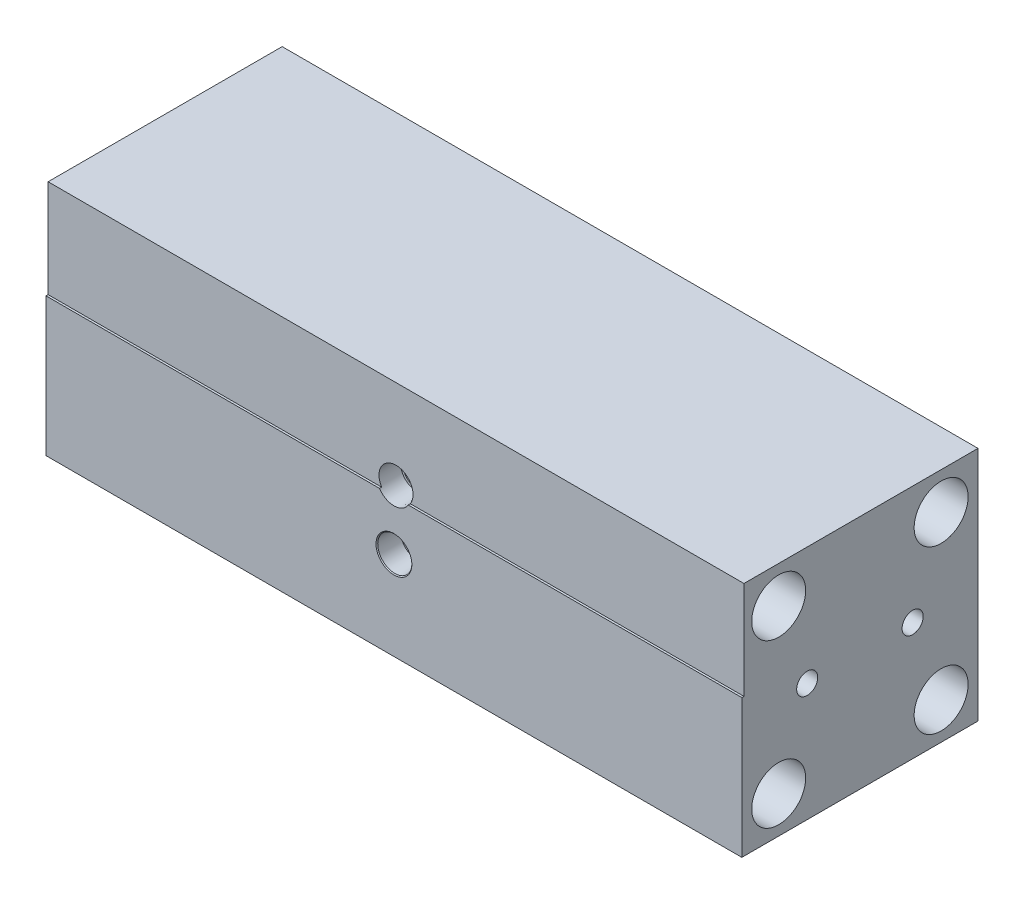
ISO-10303-21;
HEADER;
FILE_DESCRIPTION(('STEP AP214'),'2;1');
FILE_NAME('part.step','',(''),(''),'','','');
FILE_SCHEMA(('AUTOMOTIVE_DESIGN { 1 0 10303 214 1 1 1 1 }'));
ENDSEC;
DATA;
#1=APPLICATION_CONTEXT('core data for automotive mechanical design processes');
#2=APPLICATION_PROTOCOL_DEFINITION('international standard','automotive_design',2000,#1);
#3=PRODUCT_CONTEXT('',#1,'mechanical');
#4=PRODUCT('Part','Part','',(#3));
#5=PRODUCT_RELATED_PRODUCT_CATEGORY('part','',(#4));
#6=PRODUCT_DEFINITION_FORMATION('','',#4);
#7=PRODUCT_DEFINITION_CONTEXT('part definition',#1,'design');
#8=PRODUCT_DEFINITION('design','',#6,#7);
#9=PRODUCT_DEFINITION_SHAPE('','',#8);
#10=(LENGTH_UNIT() NAMED_UNIT(*) SI_UNIT(.MILLI.,.METRE.));
#11=(NAMED_UNIT(*) PLANE_ANGLE_UNIT() SI_UNIT($,.RADIAN.));
#12=(NAMED_UNIT(*) SI_UNIT($,.STERADIAN.) SOLID_ANGLE_UNIT());
#13=UNCERTAINTY_MEASURE_WITH_UNIT(LENGTH_MEASURE(1.E-05),#10,'distance_accuracy_value','');
#14=(GEOMETRIC_REPRESENTATION_CONTEXT(3) GLOBAL_UNCERTAINTY_ASSIGNED_CONTEXT((#13)) GLOBAL_UNIT_ASSIGNED_CONTEXT((#10,
#11,#12)) REPRESENTATION_CONTEXT('',''));
#15=CARTESIAN_POINT('',(0.,0.,0.));
#16=DIRECTION('',(0.,0.,1.));
#17=DIRECTION('',(1.,0.,0.));
#18=AXIS2_PLACEMENT_3D('',#15,#16,#17);
#19=CARTESIAN_POINT('',(-104.775,6.12140000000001,35.56));
#20=DIRECTION('',(0.,-1.,0.));
#21=DIRECTION('',(0.,0.,-1.));
#22=AXIS2_PLACEMENT_3D('',#19,#20,#21);
#23=PLANE('',#22);
#24=DIRECTION('',(1.,0.,0.));
#25=VECTOR('',#24,1.);
#26=CARTESIAN_POINT('',(-104.775,6.12140000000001,35.56));
#27=LINE('',#26,#25);
#28=CARTESIAN_POINT('',(-104.775,6.12140000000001,35.56));
#29=VERTEX_POINT('',#28);
#30=CARTESIAN_POINT('',(-4.33515649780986,6.12140000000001,35.56));
#31=VERTEX_POINT('',#30);
#32=EDGE_CURVE('E245',#29,#31,#27,.T.);
#33=ORIENTED_EDGE('',*,*,#32,.T.);
#34=CARTESIAN_POINT('',(-4.67359412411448,6.12140000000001,45.1884141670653));
#35=CARTESIAN_POINT('',(-4.61580467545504,6.12140000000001,43.5278837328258));
#36=CARTESIAN_POINT('',(-4.55774093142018,6.12140000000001,41.8673628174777));
#37=CARTESIAN_POINT('',(-4.44098917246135,6.12140000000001,38.5463432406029));
#38=CARTESIAN_POINT('',(-4.38230115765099,6.12140000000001,36.8858445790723));
#39=CARTESIAN_POINT('',(-4.26422515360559,6.12140000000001,33.5648720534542));
#40=CARTESIAN_POINT('',(-4.20483716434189,6.12140000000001,31.9043981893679));
#41=CARTESIAN_POINT('',(-4.08526250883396,6.12140000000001,28.583478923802));
#42=CARTESIAN_POINT('',(-4.02507584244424,6.12140000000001,26.9230335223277));
#43=CARTESIAN_POINT('',(-3.96444049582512,6.12140000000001,25.2626044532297));
#44=B_SPLINE_CURVE_WITH_KNOTS('',3,(#34,#35,#36,#37,#38,#39,#40,#41,#42,#43),.UNSPECIFIED.,.F.,
.F.,(4,2,2,2,4),(0.,4.98460717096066,9.96921343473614,14.9538199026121,19.9384272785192),.UNSPECIFIED.);
#45=CARTESIAN_POINT('',(-4.3125801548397,6.12140000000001,34.925));
#46=VERTEX_POINT('',#45);
#47=EDGE_CURVE('E281',#31,#46,#44,.T.);
#48=ORIENTED_EDGE('',*,*,#47,.T.);
#49=DIRECTION('',(1.,0.,0.));
#50=VECTOR('',#49,1.);
#51=CARTESIAN_POINT('',(-104.775,6.12140000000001,34.925));
#52=LINE('',#51,#50);
#53=CARTESIAN_POINT('',(-104.775,6.12140000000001,34.925));
#54=VERTEX_POINT('',#53);
#55=EDGE_CURVE('E241',#54,#46,#52,.T.);
#56=ORIENTED_EDGE('',*,*,#55,.F.);
#57=DIRECTION('',(0.,0.,-1.));
#58=VECTOR('',#57,1.);
#59=CARTESIAN_POINT('',(-104.775,6.12140000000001,35.56));
#60=LINE('',#59,#58);
#61=EDGE_CURVE('E60',#29,#54,#60,.T.);
#62=ORIENTED_EDGE('',*,*,#61,.F.);
#63=EDGE_LOOP('',(#33,#48,#56,#62));
#64=FACE_BOUND('',#63,.T.);
#65=ADVANCED_FACE('F37',(#64),#23,.F.);
#66=CARTESIAN_POINT('',(-104.775,-35.56,35.56));
#67=DIRECTION('',(0.,1.,0.));
#68=DIRECTION('',(0.,0.,1.));
#69=AXIS2_PLACEMENT_3D('',#66,#67,#68);
#70=PLANE('',#69);
#71=CARTESIAN_POINT('',(25.4,-35.56,0.));
#72=DIRECTION('',(0.,1.,0.));
#73=DIRECTION('',(0.,0.,1.));
#74=AXIS2_PLACEMENT_3D('',#71,#72,#73);
#75=CIRCLE('',#74,2.80669999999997);
#76=CARTESIAN_POINT('',(25.4,-35.56,2.80669999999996));
#77=VERTEX_POINT('',#76);
#78=EDGE_CURVE('E553',#77,#77,#75,.T.);
#79=ORIENTED_EDGE('',*,*,#78,.T.);
#80=EDGE_LOOP('',(#79));
#81=FACE_BOUND('',#80,.T.);
#82=CARTESIAN_POINT('',(-25.4,-35.56,0.));
#83=DIRECTION('',(0.,1.,0.));
#84=DIRECTION('',(0.,0.,1.));
#85=AXIS2_PLACEMENT_3D('',#82,#83,#84);
#86=CIRCLE('',#85,2.80669999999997);
#87=CARTESIAN_POINT('',(-25.4,-35.56,2.80669999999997));
#88=VERTEX_POINT('',#87);
#89=EDGE_CURVE('E556',#88,#88,#86,.T.);
#90=ORIENTED_EDGE('',*,*,#89,.T.);
#91=EDGE_LOOP('',(#90));
#92=FACE_BOUND('',#91,.T.);
#93=CARTESIAN_POINT('',(63.5,-35.56,0.));
#94=DIRECTION('',(0.,1.,0.));
#95=DIRECTION('',(0.,0.,1.));
#96=AXIS2_PLACEMENT_3D('',#93,#94,#95);
#97=CIRCLE('',#96,2.80669999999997);
#98=CARTESIAN_POINT('',(63.5,-35.56,2.80669999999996));
#99=VERTEX_POINT('',#98);
#100=EDGE_CURVE('E559',#99,#99,#97,.T.);
#101=ORIENTED_EDGE('',*,*,#100,.T.);
#102=EDGE_LOOP('',(#101));
#103=FACE_BOUND('',#102,.T.);
#104=CARTESIAN_POINT('',(50.8,-35.56,0.));
#105=DIRECTION('',(0.,1.,0.));
#106=DIRECTION('',(0.,0.,1.));
#107=AXIS2_PLACEMENT_3D('',#104,#105,#106);
#108=CIRCLE('',#107,3.42900000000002);
#109=CARTESIAN_POINT('',(50.8,-35.56,3.42900000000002));
#110=VERTEX_POINT('',#109);
#111=EDGE_CURVE('E562',#110,#110,#108,.T.);
#112=ORIENTED_EDGE('',*,*,#111,.T.);
#113=EDGE_LOOP('',(#112));
#114=FACE_BOUND('',#113,.T.);
#115=CARTESIAN_POINT('',(38.1,-35.56,0.));
#116=DIRECTION('',(0.,1.,0.));
#117=DIRECTION('',(0.,0.,1.));
#118=AXIS2_PLACEMENT_3D('',#115,#116,#117);
#119=CIRCLE('',#118,2.80669999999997);
#120=CARTESIAN_POINT('',(38.1,-35.56,2.80669999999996));
#121=VERTEX_POINT('',#120);
#122=EDGE_CURVE('E565',#121,#121,#119,.T.);
#123=ORIENTED_EDGE('',*,*,#122,.T.);
#124=EDGE_LOOP('',(#123));
#125=FACE_BOUND('',#124,.T.);
#126=CARTESIAN_POINT('',(-38.1,-35.56,0.));
#127=DIRECTION('',(0.,1.,0.));
#128=DIRECTION('',(0.,0.,1.));
#129=AXIS2_PLACEMENT_3D('',#126,#127,#128);
#130=CIRCLE('',#129,2.80669999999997);
#131=CARTESIAN_POINT('',(-38.1,-35.56,2.80669999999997));
#132=VERTEX_POINT('',#131);
#133=EDGE_CURVE('E568',#132,#132,#130,.T.);
#134=ORIENTED_EDGE('',*,*,#133,.T.);
#135=EDGE_LOOP('',(#134));
#136=FACE_BOUND('',#135,.T.);
#137=CARTESIAN_POINT('',(-50.8,-35.56,0.));
#138=DIRECTION('',(0.,1.,0.));
#139=DIRECTION('',(0.,0.,1.));
#140=AXIS2_PLACEMENT_3D('',#137,#138,#139);
#141=CIRCLE('',#140,3.42899999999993);
#142=CARTESIAN_POINT('',(-50.8,-35.56,3.42899999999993));
#143=VERTEX_POINT('',#142);
#144=EDGE_CURVE('E571',#143,#143,#141,.T.);
#145=ORIENTED_EDGE('',*,*,#144,.T.);
#146=EDGE_LOOP('',(#145));
#147=FACE_BOUND('',#146,.T.);
#148=CARTESIAN_POINT('',(-63.5,-35.56,0.));
#149=DIRECTION('',(0.,1.,0.));
#150=DIRECTION('',(0.,0.,1.));
#151=AXIS2_PLACEMENT_3D('',#148,#149,#150);
#152=CIRCLE('',#151,2.80669999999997);
#153=CARTESIAN_POINT('',(-63.5,-35.56,2.80669999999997));
#154=VERTEX_POINT('',#153);
#155=EDGE_CURVE('E574',#154,#154,#152,.T.);
#156=ORIENTED_EDGE('',*,*,#155,.T.);
#157=EDGE_LOOP('',(#156));
#158=FACE_BOUND('',#157,.T.);
#159=DIRECTION('',(1.,0.,0.));
#160=VECTOR('',#159,1.);
#161=CARTESIAN_POINT('',(-104.775,-35.56,-35.56));
#162=LINE('',#161,#160);
#163=CARTESIAN_POINT('',(-104.775,-35.56,-35.56));
#164=VERTEX_POINT('',#163);
#165=CARTESIAN_POINT('',(104.775,-35.56,-35.56));
#166=VERTEX_POINT('',#165);
#167=EDGE_CURVE('E258',#164,#166,#162,.T.);
#168=ORIENTED_EDGE('',*,*,#167,.T.);
#169=DIRECTION('',(0.,0.,-1.));
#170=VECTOR('',#169,1.);
#171=CARTESIAN_POINT('',(104.775,-35.56,35.56));
#172=LINE('',#171,#170);
#173=CARTESIAN_POINT('',(104.775,-35.56,35.56));
#174=VERTEX_POINT('',#173);
#175=EDGE_CURVE('E268',#174,#166,#172,.T.);
#176=ORIENTED_EDGE('',*,*,#175,.F.);
#177=DIRECTION('',(1.,0.,0.));
#178=VECTOR('',#177,1.);
#179=CARTESIAN_POINT('',(-104.775,-35.56,35.56));
#180=LINE('',#179,#178);
#181=CARTESIAN_POINT('',(-104.775,-35.56,35.56));
#182=VERTEX_POINT('',#181);
#183=EDGE_CURVE('E249',#182,#174,#180,.T.);
#184=ORIENTED_EDGE('',*,*,#183,.F.);
#185=DIRECTION('',(0.,0.,-1.));
#186=VECTOR('',#185,1.);
#187=CARTESIAN_POINT('',(-104.775,-35.56,35.56));
#188=LINE('',#187,#186);
#189=EDGE_CURVE('E271',#182,#164,#188,.T.);
#190=ORIENTED_EDGE('',*,*,#189,.T.);
#191=EDGE_LOOP('',(#168,#176,#184,#190));
#192=FACE_BOUND('',#191,.T.);
#193=ADVANCED_FACE('F387',(#81,#92,#103,#114,#125,#136,#147,#158,#192),#70,.F.);
#194=CARTESIAN_POINT('',(-104.775,35.56,35.56));
#195=DIRECTION('',(1.,0.,0.));
#196=DIRECTION('',(0.,1.,0.));
#197=AXIS2_PLACEMENT_3D('',#194,#195,#196);
#198=PLANE('',#197);
#199=CARTESIAN_POINT('',(-104.775,0.,-15.875));
#200=DIRECTION('',(1.,0.,0.));
#201=DIRECTION('',(0.,0.,-1.));
#202=AXIS2_PLACEMENT_3D('',#199,#200,#201);
#203=CIRCLE('',#202,3.175);
#204=CARTESIAN_POINT('',(-104.775,0.,-19.05));
#205=VERTEX_POINT('',#204);
#206=EDGE_CURVE('E1161',#205,#205,#203,.T.);
#207=ORIENTED_EDGE('',*,*,#206,.T.);
#208=EDGE_LOOP('',(#207));
#209=FACE_BOUND('',#208,.T.);
#210=CARTESIAN_POINT('',(-104.775,0.,15.875));
#211=DIRECTION('',(1.,0.,0.));
#212=DIRECTION('',(0.,0.,-1.));
#213=AXIS2_PLACEMENT_3D('',#210,#211,#212);
#214=CIRCLE('',#213,3.175);
#215=CARTESIAN_POINT('',(-104.775,0.,12.7));
#216=VERTEX_POINT('',#215);
#217=EDGE_CURVE('E1169',#216,#216,#214,.T.);
#218=ORIENTED_EDGE('',*,*,#217,.T.);
#219=EDGE_LOOP('',(#218));
#220=FACE_BOUND('',#219,.T.);
#221=CARTESIAN_POINT('',(-104.775,-24.4602,-24.4602));
#222=DIRECTION('',(1.,0.,0.));
#223=DIRECTION('',(0.,0.,-1.));
#224=AXIS2_PLACEMENT_3D('',#221,#222,#223);
#225=CIRCLE('',#224,8.12799999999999);
#226=CARTESIAN_POINT('',(-104.775,-24.4602,-32.5882));
#227=VERTEX_POINT('',#226);
#228=EDGE_CURVE('E1175',#227,#227,#225,.T.);
#229=ORIENTED_EDGE('',*,*,#228,.T.);
#230=EDGE_LOOP('',(#229));
#231=FACE_BOUND('',#230,.T.);
#232=CARTESIAN_POINT('',(-104.775,-24.4602,24.4602));
#233=DIRECTION('',(1.,0.,0.));
#234=DIRECTION('',(0.,0.,-1.));
#235=AXIS2_PLACEMENT_3D('',#232,#233,#234);
#236=CIRCLE('',#235,8.128);
#237=CARTESIAN_POINT('',(-104.775,-24.4602,16.3322));
#238=VERTEX_POINT('',#237);
#239=EDGE_CURVE('E1181',#238,#238,#236,.T.);
#240=ORIENTED_EDGE('',*,*,#239,.T.);
#241=EDGE_LOOP('',(#240));
#242=FACE_BOUND('',#241,.T.);
#243=CARTESIAN_POINT('',(-104.775,24.4602,-24.4602));
#244=DIRECTION('',(1.,0.,0.));
#245=DIRECTION('',(0.,0.,-1.));
#246=AXIS2_PLACEMENT_3D('',#243,#244,#245);
#247=CIRCLE('',#246,8.12799999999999);
#248=CARTESIAN_POINT('',(-104.775,24.4602,-32.5882));
#249=VERTEX_POINT('',#248);
#250=EDGE_CURVE('E1187',#249,#249,#247,.T.);
#251=ORIENTED_EDGE('',*,*,#250,.T.);
#252=EDGE_LOOP('',(#251));
#253=FACE_BOUND('',#252,.T.);
#254=CARTESIAN_POINT('',(-104.775,24.4602,24.4602));
#255=DIRECTION('',(1.,0.,0.));
#256=DIRECTION('',(0.,0.,-1.));
#257=AXIS2_PLACEMENT_3D('',#254,#255,#256);
#258=CIRCLE('',#257,8.128);
#259=CARTESIAN_POINT('',(-104.775,24.4602,16.3322));
#260=VERTEX_POINT('',#259);
#261=EDGE_CURVE('E160',#260,#260,#258,.T.);
#262=ORIENTED_EDGE('',*,*,#261,.T.);
#263=EDGE_LOOP('',(#262));
#264=FACE_BOUND('',#263,.T.);
#265=ORIENTED_EDGE('',*,*,#61,.T.);
#266=DIRECTION('',(0.,1.,0.));
#267=VECTOR('',#266,1.);
#268=CARTESIAN_POINT('',(-104.775,6.12140000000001,34.925));
#269=LINE('',#268,#267);
#270=CARTESIAN_POINT('',(-104.775,35.56,34.925));
#271=VERTEX_POINT('',#270);
#272=EDGE_CURVE('E229',#54,#271,#269,.T.);
#273=ORIENTED_EDGE('',*,*,#272,.T.);
#274=DIRECTION('',(0.,0.,-1.));
#275=VECTOR('',#274,1.);
#276=CARTESIAN_POINT('',(-104.775,35.56,35.56));
#277=LINE('',#276,#275);
#278=CARTESIAN_POINT('',(-104.775,35.56,-35.56));
#279=VERTEX_POINT('',#278);
#280=EDGE_CURVE('E255',#271,#279,#277,.T.);
#281=ORIENTED_EDGE('',*,*,#280,.T.);
#282=DIRECTION('',(0.,-1.,0.));
#283=VECTOR('',#282,1.);
#284=CARTESIAN_POINT('',(-104.775,35.56,-35.56));
#285=LINE('',#284,#283);
#286=EDGE_CURVE('E240',#279,#164,#285,.T.);
#287=ORIENTED_EDGE('',*,*,#286,.T.);
#288=ORIENTED_EDGE('',*,*,#189,.F.);
#289=DIRECTION('',(0.,-1.,0.));
#290=VECTOR('',#289,1.);
#291=CARTESIAN_POINT('',(-104.775,35.56,35.56));
#292=LINE('',#291,#290);
#293=EDGE_CURVE('E247',#29,#182,#292,.T.);
#294=ORIENTED_EDGE('',*,*,#293,.F.);
#295=EDGE_LOOP('',(#265,#273,#281,#287,#288,#294));
#296=FACE_BOUND('',#295,.T.);
#297=ADVANCED_FACE('F391',(#209,#220,#231,#242,#253,#264,#296),#198,.F.);
#298=CARTESIAN_POINT('',(104.775,-35.56,35.56));
#299=DIRECTION('',(-1.,0.,0.));
#300=DIRECTION('',(0.,0.,1.));
#301=AXIS2_PLACEMENT_3D('',#298,#299,#300);
#302=PLANE('',#301);
#303=CARTESIAN_POINT('',(104.775,0.,-15.875));
#304=DIRECTION('',(1.,0.,0.));
#305=DIRECTION('',(0.,0.,-1.));
#306=AXIS2_PLACEMENT_3D('',#303,#304,#305);
#307=CIRCLE('',#306,3.175);
#308=CARTESIAN_POINT('',(104.775,0.,-19.05));
#309=VERTEX_POINT('',#308);
#310=EDGE_CURVE('E1164',#309,#309,#307,.T.);
#311=ORIENTED_EDGE('',*,*,#310,.F.);
#312=EDGE_LOOP('',(#311));
#313=FACE_BOUND('',#312,.T.);
#314=CARTESIAN_POINT('',(104.775,0.,15.875));
#315=DIRECTION('',(1.,0.,0.));
#316=DIRECTION('',(0.,0.,-1.));
#317=AXIS2_PLACEMENT_3D('',#314,#315,#316);
#318=CIRCLE('',#317,3.175);
#319=CARTESIAN_POINT('',(104.775,0.,12.7));
#320=VERTEX_POINT('',#319);
#321=EDGE_CURVE('E1166',#320,#320,#318,.T.);
#322=ORIENTED_EDGE('',*,*,#321,.F.);
#323=EDGE_LOOP('',(#322));
#324=FACE_BOUND('',#323,.T.);
#325=CARTESIAN_POINT('',(104.775,-24.4602,-24.4602));
#326=DIRECTION('',(1.,0.,0.));
#327=DIRECTION('',(0.,0.,-1.));
#328=AXIS2_PLACEMENT_3D('',#325,#326,#327);
#329=CIRCLE('',#328,8.12799999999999);
#330=CARTESIAN_POINT('',(104.775,-24.4602,-32.5882));
#331=VERTEX_POINT('',#330);
#332=EDGE_CURVE('E1172',#331,#331,#329,.T.);
#333=ORIENTED_EDGE('',*,*,#332,.F.);
#334=EDGE_LOOP('',(#333));
#335=FACE_BOUND('',#334,.T.);
#336=CARTESIAN_POINT('',(104.775,-24.4602,24.4602));
#337=DIRECTION('',(1.,0.,0.));
#338=DIRECTION('',(0.,0.,-1.));
#339=AXIS2_PLACEMENT_3D('',#336,#337,#338);
#340=CIRCLE('',#339,8.128);
#341=CARTESIAN_POINT('',(104.775,-24.4602,16.3322));
#342=VERTEX_POINT('',#341);
#343=EDGE_CURVE('E1178',#342,#342,#340,.T.);
#344=ORIENTED_EDGE('',*,*,#343,.F.);
#345=EDGE_LOOP('',(#344));
#346=FACE_BOUND('',#345,.T.);
#347=CARTESIAN_POINT('',(104.775,24.4602,-24.4602));
#348=DIRECTION('',(1.,0.,0.));
#349=DIRECTION('',(0.,0.,-1.));
#350=AXIS2_PLACEMENT_3D('',#347,#348,#349);
#351=CIRCLE('',#350,8.12799999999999);
#352=CARTESIAN_POINT('',(104.775,24.4602,-32.5882));
#353=VERTEX_POINT('',#352);
#354=EDGE_CURVE('E1184',#353,#353,#351,.T.);
#355=ORIENTED_EDGE('',*,*,#354,.F.);
#356=EDGE_LOOP('',(#355));
#357=FACE_BOUND('',#356,.T.);
#358=CARTESIAN_POINT('',(104.775,24.4602,24.4602));
#359=DIRECTION('',(1.,0.,0.));
#360=DIRECTION('',(0.,0.,-1.));
#361=AXIS2_PLACEMENT_3D('',#358,#359,#360);
#362=CIRCLE('',#361,8.128);
#363=CARTESIAN_POINT('',(104.775,24.4602,16.3322));
#364=VERTEX_POINT('',#363);
#365=EDGE_CURVE('E166',#364,#364,#362,.T.);
#366=ORIENTED_EDGE('',*,*,#365,.F.);
#367=EDGE_LOOP('',(#366));
#368=FACE_BOUND('',#367,.T.);
#369=DIRECTION('',(0.,0.,-1.));
#370=VECTOR('',#369,1.);
#371=CARTESIAN_POINT('',(104.775,35.56,35.56));
#372=LINE('',#371,#370);
#373=CARTESIAN_POINT('',(104.775,35.56,34.925));
#374=VERTEX_POINT('',#373);
#375=CARTESIAN_POINT('',(104.775,35.56,-35.56));
#376=VERTEX_POINT('',#375);
#377=EDGE_CURVE('E266',#374,#376,#372,.T.);
#378=ORIENTED_EDGE('',*,*,#377,.F.);
#379=DIRECTION('',(0.,1.,0.));
#380=VECTOR('',#379,1.);
#381=CARTESIAN_POINT('',(104.775,6.12140000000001,34.925));
#382=LINE('',#381,#380);
#383=CARTESIAN_POINT('',(104.775,6.12140000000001,34.925));
#384=VERTEX_POINT('',#383);
#385=EDGE_CURVE('E230',#384,#374,#382,.T.);
#386=ORIENTED_EDGE('',*,*,#385,.F.);
#387=DIRECTION('',(0.,0.,-1.));
#388=VECTOR('',#387,1.);
#389=CARTESIAN_POINT('',(104.775,6.12140000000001,35.56));
#390=LINE('',#389,#388);
#391=CARTESIAN_POINT('',(104.775,6.12140000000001,35.56));
#392=VERTEX_POINT('',#391);
#393=EDGE_CURVE('E227',#392,#384,#390,.T.);
#394=ORIENTED_EDGE('',*,*,#393,.F.);
#395=DIRECTION('',(0.,1.,0.));
#396=VECTOR('',#395,1.);
#397=CARTESIAN_POINT('',(104.775,-35.56,35.56));
#398=LINE('',#397,#396);
#399=EDGE_CURVE('E252',#174,#392,#398,.T.);
#400=ORIENTED_EDGE('',*,*,#399,.F.);
#401=ORIENTED_EDGE('',*,*,#175,.T.);
#402=DIRECTION('',(0.,1.,0.));
#403=VECTOR('',#402,1.);
#404=CARTESIAN_POINT('',(104.775,-35.56,-35.56));
#405=LINE('',#404,#403);
#406=EDGE_CURVE('E260',#166,#376,#405,.T.);
#407=ORIENTED_EDGE('',*,*,#406,.T.);
#408=EDGE_LOOP('',(#378,#386,#394,#400,#401,#407));
#409=FACE_BOUND('',#408,.T.);
#410=ADVANCED_FACE('F408',(#313,#324,#335,#346,#357,#368,#409),#302,.F.);
#411=CARTESIAN_POINT('',(104.775,35.56,35.56));
#412=DIRECTION('',(0.,-1.,0.));
#413=DIRECTION('',(1.,0.,0.));
#414=AXIS2_PLACEMENT_3D('',#411,#412,#413);
#415=PLANE('',#414);
#416=ORIENTED_EDGE('',*,*,#280,.F.);
#417=DIRECTION('',(1.,0.,0.));
#418=VECTOR('',#417,1.);
#419=CARTESIAN_POINT('',(-104.775,35.56,34.925));
#420=LINE('',#419,#418);
#421=EDGE_CURVE('E237',#271,#374,#420,.T.);
#422=ORIENTED_EDGE('',*,*,#421,.T.);
#423=ORIENTED_EDGE('',*,*,#377,.T.);
#424=DIRECTION('',(-1.,0.,0.));
#425=VECTOR('',#424,1.);
#426=CARTESIAN_POINT('',(104.775,35.56,-35.56));
#427=LINE('',#426,#425);
#428=EDGE_CURVE('E250',#376,#279,#427,.T.);
#429=ORIENTED_EDGE('',*,*,#428,.T.);
#430=EDGE_LOOP('',(#416,#422,#423,#429));
#431=FACE_BOUND('',#430,.T.);
#432=ADVANCED_FACE('F415',(#431),#415,.F.);
#433=CARTESIAN_POINT('',(-104.775,35.56,35.56));
#434=DIRECTION('',(0.,0.,-1.));
#435=DIRECTION('',(-1.,0.,0.));
#436=AXIS2_PLACEMENT_3D('',#433,#434,#435);
#437=PLANE('',#436);
#438=CARTESIAN_POINT('',(0.,-8.89,35.56));
#439=DIRECTION('',(0.,0.,-1.));
#440=DIRECTION('',(-1.,0.,0.));
#441=AXIS2_PLACEMENT_3D('',#438,#439,#440);
#442=CIRCLE('',#441,5.39780479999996);
#443=CARTESIAN_POINT('',(-5.39780479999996,-8.89,35.56));
#444=VERTEX_POINT('',#443);
#445=EDGE_CURVE('E11',#444,#444,#442,.T.);
#446=ORIENTED_EDGE('',*,*,#445,.T.);
#447=EDGE_LOOP('',(#446));
#448=FACE_BOUND('',#447,.T.);
#449=CARTESIAN_POINT('',(4.33515649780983,6.12140000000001,35.56));
#450=VERTEX_POINT('',#449);
#451=EDGE_CURVE('E233',#450,#392,#27,.T.);
#452=ORIENTED_EDGE('',*,*,#451,.F.);
#453=CARTESIAN_POINT('',(0.,8.89,35.56));
#454=DIRECTION('',(0.,0.,1.));
#455=DIRECTION('',(1.,0.,0.));
#456=AXIS2_PLACEMENT_3D('',#453,#454,#455);
#457=CIRCLE('',#456,5.1438048);
#458=EDGE_CURVE('E52',#31,#450,#457,.T.);
#459=ORIENTED_EDGE('',*,*,#458,.F.);
#460=ORIENTED_EDGE('',*,*,#32,.F.);
#461=ORIENTED_EDGE('',*,*,#293,.T.);
#462=ORIENTED_EDGE('',*,*,#183,.T.);
#463=ORIENTED_EDGE('',*,*,#399,.T.);
#464=EDGE_LOOP('',(#452,#459,#460,#461,#462,#463));
#465=FACE_BOUND('',#464,.T.);
#466=ADVANCED_FACE('F383',(#448,#465),#437,.F.);
#467=CARTESIAN_POINT('',(-104.775,35.56,-35.56));
#468=DIRECTION('',(0.,0.,-1.));
#469=DIRECTION('',(-1.,0.,0.));
#470=AXIS2_PLACEMENT_3D('',#467,#468,#469);
#471=PLANE('',#470);
#472=CARTESIAN_POINT('',(-76.2,-10.16,-35.56));
#473=DIRECTION('',(0.,0.,-1.));
#474=DIRECTION('',(-1.,0.,0.));
#475=AXIS2_PLACEMENT_3D('',#472,#473,#474);
#476=CIRCLE('',#475,2.80669999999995);
#477=CARTESIAN_POINT('',(-79.0067,-10.16,-35.56));
#478=VERTEX_POINT('',#477);
#479=EDGE_CURVE('E513',#478,#478,#476,.F.);
#480=ORIENTED_EDGE('',*,*,#479,.T.);
#481=EDGE_LOOP('',(#480));
#482=FACE_BOUND('',#481,.T.);
#483=CARTESIAN_POINT('',(76.2,-10.16,-35.56));
#484=DIRECTION('',(0.,0.,-1.));
#485=DIRECTION('',(-1.,0.,0.));
#486=AXIS2_PLACEMENT_3D('',#483,#484,#485);
#487=CIRCLE('',#486,2.80669999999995);
#488=CARTESIAN_POINT('',(73.3933000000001,-10.16,-35.56));
#489=VERTEX_POINT('',#488);
#490=EDGE_CURVE('E516',#489,#489,#487,.F.);
#491=ORIENTED_EDGE('',*,*,#490,.T.);
#492=EDGE_LOOP('',(#491));
#493=FACE_BOUND('',#492,.T.);
#494=CARTESIAN_POINT('',(-76.2,10.16,-35.56));
#495=DIRECTION('',(0.,0.,-1.));
#496=DIRECTION('',(-1.,0.,0.));
#497=AXIS2_PLACEMENT_3D('',#494,#495,#496);
#498=CIRCLE('',#497,2.80669999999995);
#499=CARTESIAN_POINT('',(-79.0067,10.16,-35.56));
#500=VERTEX_POINT('',#499);
#501=EDGE_CURVE('E519',#500,#500,#498,.F.);
#502=ORIENTED_EDGE('',*,*,#501,.T.);
#503=EDGE_LOOP('',(#502));
#504=FACE_BOUND('',#503,.T.);
#505=CARTESIAN_POINT('',(63.5,-10.16,-35.56));
#506=DIRECTION('',(0.,0.,-1.));
#507=DIRECTION('',(-1.,0.,0.));
#508=AXIS2_PLACEMENT_3D('',#505,#506,#507);
#509=CIRCLE('',#508,3.42899999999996);
#510=CARTESIAN_POINT('',(60.0710000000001,-10.16,-35.56));
#511=VERTEX_POINT('',#510);
#512=EDGE_CURVE('E522',#511,#511,#509,.F.);
#513=ORIENTED_EDGE('',*,*,#512,.T.);
#514=EDGE_LOOP('',(#513));
#515=FACE_BOUND('',#514,.T.);
#516=CARTESIAN_POINT('',(-63.5,10.16,-35.56));
#517=DIRECTION('',(0.,0.,-1.));
#518=DIRECTION('',(-1.,0.,0.));
#519=AXIS2_PLACEMENT_3D('',#516,#517,#518);
#520=CIRCLE('',#519,3.42899999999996);
#521=CARTESIAN_POINT('',(-66.9289999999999,10.16,-35.56));
#522=VERTEX_POINT('',#521);
#523=EDGE_CURVE('E525',#522,#522,#520,.F.);
#524=ORIENTED_EDGE('',*,*,#523,.T.);
#525=EDGE_LOOP('',(#524));
#526=FACE_BOUND('',#525,.T.);
#527=CARTESIAN_POINT('',(76.2,10.16,-35.56));
#528=DIRECTION('',(0.,0.,-1.));
#529=DIRECTION('',(-1.,0.,0.));
#530=AXIS2_PLACEMENT_3D('',#527,#528,#529);
#531=CIRCLE('',#530,2.80669999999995);
#532=CARTESIAN_POINT('',(73.3933000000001,10.16,-35.56));
#533=VERTEX_POINT('',#532);
#534=EDGE_CURVE('E493',#533,#533,#531,.F.);
#535=ORIENTED_EDGE('',*,*,#534,.T.);
#536=EDGE_LOOP('',(#535));
#537=FACE_BOUND('',#536,.T.);
#538=ORIENTED_EDGE('',*,*,#286,.F.);
#539=ORIENTED_EDGE('',*,*,#428,.F.);
#540=ORIENTED_EDGE('',*,*,#406,.F.);
#541=ORIENTED_EDGE('',*,*,#167,.F.);
#542=EDGE_LOOP('',(#538,#539,#540,#541));
#543=FACE_BOUND('',#542,.T.);
#544=ADVANCED_FACE('F376',(#482,#493,#504,#515,#526,#537,#543),#471,.T.);
#545=CARTESIAN_POINT('',(-104.775,6.12140000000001,34.925));
#546=DIRECTION('',(0.,0.,-1.));
#547=DIRECTION('',(-1.,0.,0.));
#548=AXIS2_PLACEMENT_3D('',#545,#546,#547);
#549=PLANE('',#548);
#550=ORIENTED_EDGE('',*,*,#55,.T.);
#551=CARTESIAN_POINT('',(0.,8.89,34.925));
#552=DIRECTION('',(0.,0.,-1.));
#553=DIRECTION('',(-1.,0.,0.));
#554=AXIS2_PLACEMENT_3D('',#551,#552,#553);
#555=CIRCLE('',#554,5.12479204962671);
#556=CARTESIAN_POINT('',(4.3125801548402,6.12140000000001,34.9249999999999));
#557=VERTEX_POINT('',#556);
#558=EDGE_CURVE('E200',#46,#557,#555,.T.);
#559=ORIENTED_EDGE('',*,*,#558,.T.);
#560=EDGE_CURVE('E244',#557,#384,#52,.T.);
#561=ORIENTED_EDGE('',*,*,#560,.T.);
#562=ORIENTED_EDGE('',*,*,#385,.T.);
#563=ORIENTED_EDGE('',*,*,#421,.F.);
#564=ORIENTED_EDGE('',*,*,#272,.F.);
#565=EDGE_LOOP('',(#550,#559,#561,#562,#563,#564));
#566=FACE_BOUND('',#565,.T.);
#567=ADVANCED_FACE('F374',(#566),#549,.F.);
#568=ORIENTED_EDGE('',*,*,#560,.F.);
#569=CARTESIAN_POINT('',(3.96444049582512,6.12140000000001,25.2626044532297));
#570=CARTESIAN_POINT('',(4.02507584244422,6.12140000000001,26.9230335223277));
#571=CARTESIAN_POINT('',(4.08526250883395,6.12140000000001,28.583478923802));
#572=CARTESIAN_POINT('',(4.2048371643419,6.12140000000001,31.9043981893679));
#573=CARTESIAN_POINT('',(4.26422515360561,6.12140000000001,33.5648720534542));
#574=CARTESIAN_POINT('',(4.38230115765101,6.12140000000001,36.8858445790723));
#575=CARTESIAN_POINT('',(4.44098917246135,6.12140000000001,38.5463432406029));
#576=CARTESIAN_POINT('',(4.55774093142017,6.12140000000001,41.8673628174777));
#577=CARTESIAN_POINT('',(4.61580467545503,6.12140000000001,43.5278837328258));
#578=CARTESIAN_POINT('',(4.67359412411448,6.12140000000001,45.1884141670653));
#579=B_SPLINE_CURVE_WITH_KNOTS('',3,(#569,#570,#571,#572,#573,#574,#575,#576,#577,#578),
.UNSPECIFIED.,.F.,.F.,(4,2,2,2,4),(0.,4.98460737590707,9.96921384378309,14.9538201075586,
19.9384272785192),.UNSPECIFIED.);
#580=EDGE_CURVE('E274',#557,#450,#579,.T.);
#581=ORIENTED_EDGE('',*,*,#580,.T.);
#582=ORIENTED_EDGE('',*,*,#451,.T.);
#583=ORIENTED_EDGE('',*,*,#393,.T.);
#584=EDGE_LOOP('',(#568,#581,#582,#583));
#585=FACE_BOUND('',#584,.T.);
#586=ADVANCED_FACE('F286',(#585),#23,.F.);
#587=CARTESIAN_POINT('',(25.4,-21.2598,0.));
#588=DIRECTION('',(0.,-1.,0.));
#589=DIRECTION('',(0.,0.,-1.));
#590=AXIS2_PLACEMENT_3D('',#587,#588,#589);
#591=CONICAL_SURFACE('',#590,2.5527,1.02974425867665);
#592=CARTESIAN_POINT('',(25.4,-19.7259830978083,0.));
#593=VERTEX_POINT('',#592);
#594=VERTEX_LOOP('',#593);
#595=FACE_BOUND('',#594,.T.);
#596=CARTESIAN_POINT('',(25.4,-21.2598,0.));
#597=DIRECTION('',(0.,-1.,0.));
#598=DIRECTION('',(0.,0.,-1.));
#599=AXIS2_PLACEMENT_3D('',#596,#597,#598);
#600=CIRCLE('',#599,2.5527);
#601=CARTESIAN_POINT('',(25.4,-21.2598,-2.55270000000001));
#602=VERTEX_POINT('',#601);
#603=EDGE_CURVE('E224',#602,#602,#600,.T.);
#604=ORIENTED_EDGE('',*,*,#603,.T.);
#605=EDGE_LOOP('',(#604));
#606=FACE_BOUND('',#605,.T.);
#607=ADVANCED_FACE('F370',(#595,#606),#591,.F.);
#608=CARTESIAN_POINT('',(25.4,-35.56,0.));
#609=DIRECTION('',(0.,-1.,0.));
#610=DIRECTION('',(0.,0.,-1.));
#611=AXIS2_PLACEMENT_3D('',#608,#609,#610);
#612=CYLINDRICAL_SURFACE('',#611,2.5527);
#613=CARTESIAN_POINT('',(25.4,-35.306,0.));
#614=DIRECTION('',(0.,1.,0.));
#615=DIRECTION('',(0.,0.,1.));
#616=AXIS2_PLACEMENT_3D('',#613,#614,#615);
#617=CIRCLE('',#616,2.5527);
#618=CARTESIAN_POINT('',(25.4,-35.306,2.55269999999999));
#619=VERTEX_POINT('',#618);
#620=EDGE_CURVE('E576',#619,#619,#617,.F.);
#621=ORIENTED_EDGE('',*,*,#620,.T.);
#622=EDGE_LOOP('',(#621));
#623=FACE_BOUND('',#622,.T.);
#624=ORIENTED_EDGE('',*,*,#603,.F.);
#625=EDGE_LOOP('',(#624));
#626=FACE_BOUND('',#625,.T.);
#627=ADVANCED_FACE('F366',(#623,#626),#612,.F.);
#628=CARTESIAN_POINT('',(-25.4,-21.2598,0.));
#629=DIRECTION('',(0.,-1.,0.));
#630=DIRECTION('',(0.,0.,-1.));
#631=AXIS2_PLACEMENT_3D('',#628,#629,#630);
#632=CONICAL_SURFACE('',#631,2.5527,1.02974425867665);
#633=CARTESIAN_POINT('',(-25.4,-19.7259830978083,0.));
#634=VERTEX_POINT('',#633);
#635=VERTEX_LOOP('',#634);
#636=FACE_BOUND('',#635,.T.);
#637=CARTESIAN_POINT('',(-25.4,-21.2598,0.));
#638=DIRECTION('',(0.,-1.,0.));
#639=DIRECTION('',(0.,0.,-1.));
#640=AXIS2_PLACEMENT_3D('',#637,#638,#639);
#641=CIRCLE('',#640,2.5527);
#642=CARTESIAN_POINT('',(-25.4,-21.2598,-2.5527));
#643=VERTEX_POINT('',#642);
#644=EDGE_CURVE('E221',#643,#643,#641,.T.);
#645=ORIENTED_EDGE('',*,*,#644,.T.);
#646=EDGE_LOOP('',(#645));
#647=FACE_BOUND('',#646,.T.);
#648=ADVANCED_FACE('F362',(#636,#647),#632,.F.);
#649=CARTESIAN_POINT('',(-25.4,-35.56,0.));
#650=DIRECTION('',(0.,-1.,0.));
#651=DIRECTION('',(0.,0.,-1.));
#652=AXIS2_PLACEMENT_3D('',#649,#650,#651);
#653=CYLINDRICAL_SURFACE('',#652,2.5527);
#654=CARTESIAN_POINT('',(-25.4,-35.306,0.));
#655=DIRECTION('',(0.,1.,0.));
#656=DIRECTION('',(0.,0.,1.));
#657=AXIS2_PLACEMENT_3D('',#654,#655,#656);
#658=CIRCLE('',#657,2.5527);
#659=CARTESIAN_POINT('',(-25.4,-35.306,2.5527));
#660=VERTEX_POINT('',#659);
#661=EDGE_CURVE('E550',#660,#660,#658,.F.);
#662=ORIENTED_EDGE('',*,*,#661,.T.);
#663=EDGE_LOOP('',(#662));
#664=FACE_BOUND('',#663,.T.);
#665=ORIENTED_EDGE('',*,*,#644,.F.);
#666=EDGE_LOOP('',(#665));
#667=FACE_BOUND('',#666,.T.);
#668=ADVANCED_FACE('F358',(#664,#667),#653,.F.);
#669=CARTESIAN_POINT('',(38.1,-21.2598,0.));
#670=DIRECTION('',(0.,-1.,0.));
#671=DIRECTION('',(0.,0.,-1.));
#672=AXIS2_PLACEMENT_3D('',#669,#670,#671);
#673=CONICAL_SURFACE('',#672,2.5527,1.02974425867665);
#674=CARTESIAN_POINT('',(38.1,-19.7259830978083,0.));
#675=VERTEX_POINT('',#674);
#676=VERTEX_LOOP('',#675);
#677=FACE_BOUND('',#676,.T.);
#678=CARTESIAN_POINT('',(38.1,-21.2598,0.));
#679=DIRECTION('',(0.,-1.,0.));
#680=DIRECTION('',(0.,0.,-1.));
#681=AXIS2_PLACEMENT_3D('',#678,#679,#680);
#682=CIRCLE('',#681,2.5527);
#683=CARTESIAN_POINT('',(38.1,-21.2598,-2.55270000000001));
#684=VERTEX_POINT('',#683);
#685=EDGE_CURVE('E218',#684,#684,#682,.T.);
#686=ORIENTED_EDGE('',*,*,#685,.T.);
#687=EDGE_LOOP('',(#686));
#688=FACE_BOUND('',#687,.T.);
#689=ADVANCED_FACE('F354',(#677,#688),#673,.F.);
#690=CARTESIAN_POINT('',(38.1,-35.56,0.));
#691=DIRECTION('',(0.,-1.,0.));
#692=DIRECTION('',(0.,0.,-1.));
#693=AXIS2_PLACEMENT_3D('',#690,#691,#692);
#694=CYLINDRICAL_SURFACE('',#693,2.5527);
#695=CARTESIAN_POINT('',(38.1,-35.306,0.));
#696=DIRECTION('',(0.,1.,0.));
#697=DIRECTION('',(0.,0.,1.));
#698=AXIS2_PLACEMENT_3D('',#695,#696,#697);
#699=CIRCLE('',#698,2.5527);
#700=CARTESIAN_POINT('',(38.1,-35.306,2.55269999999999));
#701=VERTEX_POINT('',#700);
#702=EDGE_CURVE('E541',#701,#701,#699,.F.);
#703=ORIENTED_EDGE('',*,*,#702,.T.);
#704=EDGE_LOOP('',(#703));
#705=FACE_BOUND('',#704,.T.);
#706=ORIENTED_EDGE('',*,*,#685,.F.);
#707=EDGE_LOOP('',(#706));
#708=FACE_BOUND('',#707,.T.);
#709=ADVANCED_FACE('F350',(#705,#708),#694,.F.);
#710=CARTESIAN_POINT('',(-38.1,-21.2598,0.));
#711=DIRECTION('',(0.,-1.,0.));
#712=DIRECTION('',(0.,0.,-1.));
#713=AXIS2_PLACEMENT_3D('',#710,#711,#712);
#714=CONICAL_SURFACE('',#713,2.5527,1.02974425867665);
#715=CARTESIAN_POINT('',(-38.1,-19.7259830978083,0.));
#716=VERTEX_POINT('',#715);
#717=VERTEX_LOOP('',#716);
#718=FACE_BOUND('',#717,.T.);
#719=CARTESIAN_POINT('',(-38.1,-21.2598,0.));
#720=DIRECTION('',(0.,-1.,0.));
#721=DIRECTION('',(0.,0.,-1.));
#722=AXIS2_PLACEMENT_3D('',#719,#720,#721);
#723=CIRCLE('',#722,2.5527);
#724=CARTESIAN_POINT('',(-38.1,-21.2598,-2.55269999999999));
#725=VERTEX_POINT('',#724);
#726=EDGE_CURVE('E215',#725,#725,#723,.T.);
#727=ORIENTED_EDGE('',*,*,#726,.T.);
#728=EDGE_LOOP('',(#727));
#729=FACE_BOUND('',#728,.T.);
#730=ADVANCED_FACE('F346',(#718,#729),#714,.F.);
#731=CARTESIAN_POINT('',(-38.1,-35.56,0.));
#732=DIRECTION('',(0.,-1.,0.));
#733=DIRECTION('',(0.,0.,-1.));
#734=AXIS2_PLACEMENT_3D('',#731,#732,#733);
#735=CYLINDRICAL_SURFACE('',#734,2.5527);
#736=CARTESIAN_POINT('',(-38.1,-35.306,0.));
#737=DIRECTION('',(0.,1.,0.));
#738=DIRECTION('',(0.,0.,1.));
#739=AXIS2_PLACEMENT_3D('',#736,#737,#738);
#740=CIRCLE('',#739,2.5527);
#741=CARTESIAN_POINT('',(-38.1,-35.306,2.5527));
#742=VERTEX_POINT('',#741);
#743=EDGE_CURVE('E538',#742,#742,#740,.F.);
#744=ORIENTED_EDGE('',*,*,#743,.T.);
#745=EDGE_LOOP('',(#744));
#746=FACE_BOUND('',#745,.T.);
#747=ORIENTED_EDGE('',*,*,#726,.F.);
#748=EDGE_LOOP('',(#747));
#749=FACE_BOUND('',#748,.T.);
#750=ADVANCED_FACE('F342',(#746,#749),#735,.F.);
#751=CARTESIAN_POINT('',(63.5,-21.2598,0.));
#752=DIRECTION('',(0.,-1.,0.));
#753=DIRECTION('',(0.,0.,-1.));
#754=AXIS2_PLACEMENT_3D('',#751,#752,#753);
#755=CONICAL_SURFACE('',#754,2.55269999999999,1.02974425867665);
#756=CARTESIAN_POINT('',(63.5,-19.7259830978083,0.));
#757=VERTEX_POINT('',#756);
#758=VERTEX_LOOP('',#757);
#759=FACE_BOUND('',#758,.T.);
#760=CARTESIAN_POINT('',(63.5,-21.2598,0.));
#761=DIRECTION('',(0.,-1.,0.));
#762=DIRECTION('',(0.,0.,-1.));
#763=AXIS2_PLACEMENT_3D('',#760,#761,#762);
#764=CIRCLE('',#763,2.55269999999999);
#765=CARTESIAN_POINT('',(63.5,-21.2598,-2.5527));
#766=VERTEX_POINT('',#765);
#767=EDGE_CURVE('E212',#766,#766,#764,.T.);
#768=ORIENTED_EDGE('',*,*,#767,.T.);
#769=EDGE_LOOP('',(#768));
#770=FACE_BOUND('',#769,.T.);
#771=ADVANCED_FACE('F338',(#759,#770),#755,.F.);
#772=CARTESIAN_POINT('',(63.5,-35.56,0.));
#773=DIRECTION('',(0.,-1.,0.));
#774=DIRECTION('',(0.,0.,-1.));
#775=AXIS2_PLACEMENT_3D('',#772,#773,#774);
#776=CYLINDRICAL_SURFACE('',#775,2.5527);
#777=CARTESIAN_POINT('',(63.5,-35.306,0.));
#778=DIRECTION('',(0.,1.,0.));
#779=DIRECTION('',(0.,0.,1.));
#780=AXIS2_PLACEMENT_3D('',#777,#778,#779);
#781=CIRCLE('',#780,2.5527);
#782=CARTESIAN_POINT('',(63.5,-35.306,2.55269999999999));
#783=VERTEX_POINT('',#782);
#784=EDGE_CURVE('E547',#783,#783,#781,.F.);
#785=ORIENTED_EDGE('',*,*,#784,.T.);
#786=EDGE_LOOP('',(#785));
#787=FACE_BOUND('',#786,.T.);
#788=ORIENTED_EDGE('',*,*,#767,.F.);
#789=EDGE_LOOP('',(#788));
#790=FACE_BOUND('',#789,.T.);
#791=ADVANCED_FACE('F334',(#787,#790),#776,.F.);
#792=CARTESIAN_POINT('',(-63.5,-21.2598,0.));
#793=DIRECTION('',(0.,-1.,0.));
#794=DIRECTION('',(0.,0.,-1.));
#795=AXIS2_PLACEMENT_3D('',#792,#793,#794);
#796=CONICAL_SURFACE('',#795,2.5527,1.02974425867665);
#797=CARTESIAN_POINT('',(-63.5,-19.7259830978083,0.));
#798=VERTEX_POINT('',#797);
#799=VERTEX_LOOP('',#798);
#800=FACE_BOUND('',#799,.T.);
#801=CARTESIAN_POINT('',(-63.5,-21.2598,0.));
#802=DIRECTION('',(0.,-1.,0.));
#803=DIRECTION('',(0.,0.,-1.));
#804=AXIS2_PLACEMENT_3D('',#801,#802,#803);
#805=CIRCLE('',#804,2.5527);
#806=CARTESIAN_POINT('',(-63.5,-21.2598,-2.5527));
#807=VERTEX_POINT('',#806);
#808=EDGE_CURVE('E209',#807,#807,#805,.T.);
#809=ORIENTED_EDGE('',*,*,#808,.T.);
#810=EDGE_LOOP('',(#809));
#811=FACE_BOUND('',#810,.T.);
#812=ADVANCED_FACE('F330',(#800,#811),#796,.F.);
#813=CARTESIAN_POINT('',(-63.5,-35.56,0.));
#814=DIRECTION('',(0.,-1.,0.));
#815=DIRECTION('',(0.,0.,-1.));
#816=AXIS2_PLACEMENT_3D('',#813,#814,#815);
#817=CYLINDRICAL_SURFACE('',#816,2.5527);
#818=CARTESIAN_POINT('',(-63.5,-35.306,0.));
#819=DIRECTION('',(0.,1.,0.));
#820=DIRECTION('',(0.,0.,1.));
#821=AXIS2_PLACEMENT_3D('',#818,#819,#820);
#822=CIRCLE('',#821,2.5527);
#823=CARTESIAN_POINT('',(-63.5,-35.306,2.5527));
#824=VERTEX_POINT('',#823);
#825=EDGE_CURVE('E532',#824,#824,#822,.F.);
#826=ORIENTED_EDGE('',*,*,#825,.T.);
#827=EDGE_LOOP('',(#826));
#828=FACE_BOUND('',#827,.T.);
#829=ORIENTED_EDGE('',*,*,#808,.F.);
#830=EDGE_LOOP('',(#829));
#831=FACE_BOUND('',#830,.T.);
#832=ADVANCED_FACE('F326',(#828,#831),#817,.F.);
#833=CARTESIAN_POINT('',(50.8,-29.21,0.));
#834=DIRECTION('',(0.,-1.,0.));
#835=DIRECTION('',(0.,0.,-1.));
#836=AXIS2_PLACEMENT_3D('',#833,#834,#835);
#837=CONICAL_SURFACE('',#836,3.175,1.02974425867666);
#838=CARTESIAN_POINT('',(50.8,-27.3022675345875,0.));
#839=VERTEX_POINT('',#838);
#840=VERTEX_LOOP('',#839);
#841=FACE_BOUND('',#840,.T.);
#842=CARTESIAN_POINT('',(50.8,-29.21,0.));
#843=DIRECTION('',(0.,-1.,0.));
#844=DIRECTION('',(0.,0.,-1.));
#845=AXIS2_PLACEMENT_3D('',#842,#843,#844);
#846=CIRCLE('',#845,3.175);
#847=CARTESIAN_POINT('',(50.8,-29.21,-3.17499999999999));
#848=VERTEX_POINT('',#847);
#849=EDGE_CURVE('E206',#848,#848,#846,.T.);
#850=ORIENTED_EDGE('',*,*,#849,.T.);
#851=EDGE_LOOP('',(#850));
#852=FACE_BOUND('',#851,.T.);
#853=ADVANCED_FACE('F322',(#841,#852),#837,.F.);
#854=CARTESIAN_POINT('',(50.8,-35.56,0.));
#855=DIRECTION('',(0.,-1.,0.));
#856=DIRECTION('',(0.,0.,-1.));
#857=AXIS2_PLACEMENT_3D('',#854,#855,#856);
#858=CYLINDRICAL_SURFACE('',#857,3.175);
#859=CARTESIAN_POINT('',(50.8,-35.306,0.));
#860=DIRECTION('',(0.,1.,0.));
#861=DIRECTION('',(0.,0.,1.));
#862=AXIS2_PLACEMENT_3D('',#859,#860,#861);
#863=CIRCLE('',#862,3.175);
#864=CARTESIAN_POINT('',(50.8,-35.306,3.175));
#865=VERTEX_POINT('',#864);
#866=EDGE_CURVE('E544',#865,#865,#863,.F.);
#867=ORIENTED_EDGE('',*,*,#866,.T.);
#868=EDGE_LOOP('',(#867));
#869=FACE_BOUND('',#868,.T.);
#870=ORIENTED_EDGE('',*,*,#849,.F.);
#871=EDGE_LOOP('',(#870));
#872=FACE_BOUND('',#871,.T.);
#873=ADVANCED_FACE('F318',(#869,#872),#858,.F.);
#874=CARTESIAN_POINT('',(-50.8,-29.21,0.));
#875=DIRECTION('',(0.,-1.,0.));
#876=DIRECTION('',(0.,0.,-1.));
#877=AXIS2_PLACEMENT_3D('',#874,#875,#876);
#878=CONICAL_SURFACE('',#877,3.175,1.02974425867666);
#879=CARTESIAN_POINT('',(-50.8,-27.3022675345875,0.));
#880=VERTEX_POINT('',#879);
#881=VERTEX_LOOP('',#880);
#882=FACE_BOUND('',#881,.T.);
#883=CARTESIAN_POINT('',(-50.8,-29.21,0.));
#884=DIRECTION('',(0.,-1.,0.));
#885=DIRECTION('',(0.,0.,-1.));
#886=AXIS2_PLACEMENT_3D('',#883,#884,#885);
#887=CIRCLE('',#886,3.175);
#888=CARTESIAN_POINT('',(-50.8,-29.21,-3.175));
#889=VERTEX_POINT('',#888);
#890=EDGE_CURVE('E203',#889,#889,#887,.T.);
#891=ORIENTED_EDGE('',*,*,#890,.T.);
#892=EDGE_LOOP('',(#891));
#893=FACE_BOUND('',#892,.T.);
#894=ADVANCED_FACE('F314',(#882,#893),#878,.F.);
#895=CARTESIAN_POINT('',(-50.8,-35.56,0.));
#896=DIRECTION('',(0.,-1.,0.));
#897=DIRECTION('',(0.,0.,-1.));
#898=AXIS2_PLACEMENT_3D('',#895,#896,#897);
#899=CYLINDRICAL_SURFACE('',#898,3.175);
#900=CARTESIAN_POINT('',(-50.8,-35.306,0.));
#901=DIRECTION('',(0.,1.,0.));
#902=DIRECTION('',(0.,0.,1.));
#903=AXIS2_PLACEMENT_3D('',#900,#901,#902);
#904=CIRCLE('',#903,3.175);
#905=CARTESIAN_POINT('',(-50.8,-35.306,3.175));
#906=VERTEX_POINT('',#905);
#907=EDGE_CURVE('E535',#906,#906,#904,.F.);
#908=ORIENTED_EDGE('',*,*,#907,.T.);
#909=EDGE_LOOP('',(#908));
#910=FACE_BOUND('',#909,.T.);
#911=ORIENTED_EDGE('',*,*,#890,.F.);
#912=EDGE_LOOP('',(#911));
#913=FACE_BOUND('',#912,.T.);
#914=ADVANCED_FACE('F296',(#910,#913),#899,.F.);
#915=CARTESIAN_POINT('',(0.,8.89,35.56));
#916=DIRECTION('',(0.,0.,1.));
#917=DIRECTION('',(1.,0.,0.));
#918=AXIS2_PLACEMENT_3D('',#915,#916,#917);
#919=CONICAL_SURFACE('',#918,5.1438048,0.0299323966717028);
#920=CARTESIAN_POINT('',(0.,8.89,28.6258));
#921=DIRECTION('',(0.,0.,1.));
#922=DIRECTION('',(1.,0.,0.));
#923=AXIS2_PLACEMENT_3D('',#920,#921,#922);
#924=CIRCLE('',#923,4.9361855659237);
#925=CARTESIAN_POINT('',(4.9361855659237,8.89,28.6258));
#926=VERTEX_POINT('',#925);
#927=EDGE_CURVE('E191',#926,#926,#924,.T.);
#928=ORIENTED_EDGE('',*,*,#927,.F.);
#929=EDGE_LOOP('',(#928));
#930=FACE_BOUND('',#929,.T.);
#931=ORIENTED_EDGE('',*,*,#458,.T.);
#932=ORIENTED_EDGE('',*,*,#580,.F.);
#933=ORIENTED_EDGE('',*,*,#558,.F.);
#934=ORIENTED_EDGE('',*,*,#47,.F.);
#935=EDGE_LOOP('',(#931,#932,#933,#934));
#936=FACE_BOUND('',#935,.T.);
#937=ADVANCED_FACE('F290',(#930,#936),#919,.F.);
#938=CARTESIAN_POINT('',(0.,8.89,23.9268));
#939=DIRECTION('',(0.,0.,1.));
#940=DIRECTION('',(1.,0.,0.));
#941=AXIS2_PLACEMENT_3D('',#938,#939,#940);
#942=CONICAL_SURFACE('',#941,4.2164,1.02974425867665);
#943=CARTESIAN_POINT('',(0.,8.89,21.3933312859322));
#944=VERTEX_POINT('',#943);
#945=VERTEX_LOOP('',#944);
#946=FACE_BOUND('',#945,.T.);
#947=CARTESIAN_POINT('',(0.,8.89,23.9268));
#948=DIRECTION('',(0.,0.,1.));
#949=DIRECTION('',(1.,0.,0.));
#950=AXIS2_PLACEMENT_3D('',#947,#948,#949);
#951=CIRCLE('',#950,4.2164);
#952=CARTESIAN_POINT('',(4.2164,8.89,23.9268));
#953=VERTEX_POINT('',#952);
#954=EDGE_CURVE('E197',#953,#953,#951,.T.);
#955=ORIENTED_EDGE('',*,*,#954,.T.);
#956=EDGE_LOOP('',(#955));
#957=FACE_BOUND('',#956,.T.);
#958=ADVANCED_FACE('F295',(#946,#957),#942,.F.);
#959=CARTESIAN_POINT('',(0.,8.89,35.56));
#960=DIRECTION('',(0.,0.,1.));
#961=DIRECTION('',(1.,0.,0.));
#962=AXIS2_PLACEMENT_3D('',#959,#960,#961);
#963=CYLINDRICAL_SURFACE('',#962,4.2164);
#964=ORIENTED_EDGE('',*,*,#954,.F.);
#965=EDGE_LOOP('',(#964));
#966=FACE_BOUND('',#965,.T.);
#967=CARTESIAN_POINT('',(0.,8.89,28.6258));
#968=DIRECTION('',(0.,0.,1.));
#969=DIRECTION('',(1.,0.,0.));
#970=AXIS2_PLACEMENT_3D('',#967,#968,#969);
#971=CIRCLE('',#970,4.2164);
#972=CARTESIAN_POINT('',(4.2164,8.89,28.6258));
#973=VERTEX_POINT('',#972);
#974=EDGE_CURVE('E194',#973,#973,#971,.T.);
#975=ORIENTED_EDGE('',*,*,#974,.T.);
#976=EDGE_LOOP('',(#975));
#977=FACE_BOUND('',#976,.T.);
#978=ADVANCED_FACE('F304',(#966,#977),#963,.F.);
#979=CARTESIAN_POINT('',(4.2164,8.89,28.6258));
#980=DIRECTION('',(0.,0.,-1.));
#981=DIRECTION('',(-1.,0.,0.));
#982=AXIS2_PLACEMENT_3D('',#979,#980,#981);
#983=PLANE('',#982);
#984=ORIENTED_EDGE('',*,*,#974,.F.);
#985=EDGE_LOOP('',(#984));
#986=FACE_BOUND('',#985,.T.);
#987=ORIENTED_EDGE('',*,*,#927,.T.);
#988=EDGE_LOOP('',(#987));
#989=FACE_BOUND('',#988,.T.);
#990=ADVANCED_FACE('F300',(#986,#989),#983,.F.);
#991=CARTESIAN_POINT('',(0.,-8.89,23.9268));
#992=DIRECTION('',(0.,0.,1.));
#993=DIRECTION('',(1.,0.,0.));
#994=AXIS2_PLACEMENT_3D('',#991,#992,#993);
#995=CONICAL_SURFACE('',#994,4.2164,1.02974425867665);
#996=CARTESIAN_POINT('',(0.,-8.89,21.3933312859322));
#997=VERTEX_POINT('',#996);
#998=VERTEX_LOOP('',#997);
#999=FACE_BOUND('',#998,.T.);
#1000=CARTESIAN_POINT('',(0.,-8.89,23.9268));
#1001=DIRECTION('',(0.,0.,1.));
#1002=DIRECTION('',(1.,0.,0.));
#1003=AXIS2_PLACEMENT_3D('',#1000,#1001,#1002);
#1004=CIRCLE('',#1003,4.2164);
#1005=CARTESIAN_POINT('',(4.2164,-8.89,23.9268));
#1006=VERTEX_POINT('',#1005);
#1007=EDGE_CURVE('E187',#1006,#1006,#1004,.T.);
#1008=ORIENTED_EDGE('',*,*,#1007,.T.);
#1009=EDGE_LOOP('',(#1008));
#1010=FACE_BOUND('',#1009,.T.);
#1011=ADVANCED_FACE('F298',(#999,#1010),#995,.F.);
#1012=CARTESIAN_POINT('',(0.,-8.89,35.56));
#1013=DIRECTION('',(0.,0.,1.));
#1014=DIRECTION('',(1.,0.,0.));
#1015=AXIS2_PLACEMENT_3D('',#1012,#1013,#1014);
#1016=CYLINDRICAL_SURFACE('',#1015,4.2164);
#1017=ORIENTED_EDGE('',*,*,#1007,.F.);
#1018=EDGE_LOOP('',(#1017));
#1019=FACE_BOUND('',#1018,.T.);
#1020=CARTESIAN_POINT('',(0.,-8.89,28.6258));
#1021=DIRECTION('',(0.,0.,1.));
#1022=DIRECTION('',(1.,0.,0.));
#1023=AXIS2_PLACEMENT_3D('',#1020,#1021,#1022);
#1024=CIRCLE('',#1023,4.2164);
#1025=CARTESIAN_POINT('',(4.2164,-8.89,28.6258));
#1026=VERTEX_POINT('',#1025);
#1027=EDGE_CURVE('E184',#1026,#1026,#1024,.T.);
#1028=ORIENTED_EDGE('',*,*,#1027,.T.);
#1029=EDGE_LOOP('',(#1028));
#1030=FACE_BOUND('',#1029,.T.);
#1031=ADVANCED_FACE('F657',(#1019,#1030),#1016,.F.);
#1032=CARTESIAN_POINT('',(4.2164,-8.89,28.6258));
#1033=DIRECTION('',(0.,0.,-1.));
#1034=DIRECTION('',(-1.,0.,0.));
#1035=AXIS2_PLACEMENT_3D('',#1032,#1033,#1034);
#1036=PLANE('',#1035);
#1037=ORIENTED_EDGE('',*,*,#1027,.F.);
#1038=EDGE_LOOP('',(#1037));
#1039=FACE_BOUND('',#1038,.T.);
#1040=CARTESIAN_POINT('',(0.,-8.89,28.6258));
#1041=DIRECTION('',(0.,0.,1.));
#1042=DIRECTION('',(1.,0.,0.));
#1043=AXIS2_PLACEMENT_3D('',#1040,#1041,#1042);
#1044=CIRCLE('',#1043,4.9361855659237);
#1045=CARTESIAN_POINT('',(4.9361855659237,-8.89,28.6258));
#1046=VERTEX_POINT('',#1045);
#1047=EDGE_CURVE('E181',#1046,#1046,#1044,.T.);
#1048=ORIENTED_EDGE('',*,*,#1047,.T.);
#1049=EDGE_LOOP('',(#1048));
#1050=FACE_BOUND('',#1049,.T.);
#1051=ADVANCED_FACE('F651',(#1039,#1050),#1036,.F.);
#1052=CARTESIAN_POINT('',(0.,-8.89,35.56));
#1053=DIRECTION('',(0.,0.,1.));
#1054=DIRECTION('',(1.,0.,0.));
#1055=AXIS2_PLACEMENT_3D('',#1052,#1053,#1054);
#1056=CONICAL_SURFACE('',#1055,5.1438048,0.0299323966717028);
#1057=CARTESIAN_POINT('',(0.,-8.89,35.2981601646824));
#1058=DIRECTION('',(0.,0.,-1.));
#1059=DIRECTION('',(-1.,0.,0.));
#1060=AXIS2_PLACEMENT_3D('',#1057,#1058,#1059);
#1061=CIRCLE('',#1060,5.1359649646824);
#1062=CARTESIAN_POINT('',(-5.1359649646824,-8.89,35.2981601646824));
#1063=VERTEX_POINT('',#1062);
#1064=EDGE_CURVE('E45',#1063,#1063,#1061,.F.);
#1065=ORIENTED_EDGE('',*,*,#1064,.T.);
#1066=EDGE_LOOP('',(#1065));
#1067=FACE_BOUND('',#1066,.T.);
#1068=ORIENTED_EDGE('',*,*,#1047,.F.);
#1069=EDGE_LOOP('',(#1068));
#1070=FACE_BOUND('',#1069,.T.);
#1071=ADVANCED_FACE('F645',(#1067,#1070),#1056,.F.);
#1072=CARTESIAN_POINT('',(-76.2,-10.16,-19.685));
#1073=DIRECTION('',(0.,0.,-1.));
#1074=DIRECTION('',(-1.,0.,0.));
#1075=AXIS2_PLACEMENT_3D('',#1072,#1073,#1074);
#1076=CONICAL_SURFACE('',#1075,2.55269999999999,1.02974425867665);
#1077=CARTESIAN_POINT('',(-76.2,-10.16,-18.1511830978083));
#1078=VERTEX_POINT('',#1077);
#1079=VERTEX_LOOP('',#1078);
#1080=FACE_BOUND('',#1079,.T.);
#1081=CARTESIAN_POINT('',(-76.2,-10.16,-19.685));
#1082=DIRECTION('',(0.,0.,-1.));
#1083=DIRECTION('',(-1.,0.,0.));
#1084=AXIS2_PLACEMENT_3D('',#1081,#1082,#1083);
#1085=CIRCLE('',#1084,2.55269999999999);
#1086=CARTESIAN_POINT('',(-78.7527,-10.16,-19.685));
#1087=VERTEX_POINT('',#1086);
#1088=EDGE_CURVE('E178',#1087,#1087,#1085,.T.);
#1089=ORIENTED_EDGE('',*,*,#1088,.T.);
#1090=EDGE_LOOP('',(#1089));
#1091=FACE_BOUND('',#1090,.T.);
#1092=ADVANCED_FACE('F640',(#1080,#1091),#1076,.F.);
#1093=CARTESIAN_POINT('',(-76.2,-10.16,-35.56));
#1094=DIRECTION('',(0.,0.,-1.));
#1095=DIRECTION('',(-1.,0.,0.));
#1096=AXIS2_PLACEMENT_3D('',#1093,#1094,#1095);
#1097=CYLINDRICAL_SURFACE('',#1096,2.5527);
#1098=CARTESIAN_POINT('',(-76.2,-10.16,-35.3060000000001));
#1099=DIRECTION('',(0.,0.,-1.));
#1100=DIRECTION('',(-1.,0.,0.));
#1101=AXIS2_PLACEMENT_3D('',#1098,#1099,#1100);
#1102=CIRCLE('',#1101,2.5527);
#1103=CARTESIAN_POINT('',(-78.7527,-10.16,-35.3060000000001));
#1104=VERTEX_POINT('',#1103);
#1105=EDGE_CURVE('E529',#1104,#1104,#1102,.T.);
#1106=ORIENTED_EDGE('',*,*,#1105,.T.);
#1107=EDGE_LOOP('',(#1106));
#1108=FACE_BOUND('',#1107,.T.);
#1109=ORIENTED_EDGE('',*,*,#1088,.F.);
#1110=EDGE_LOOP('',(#1109));
#1111=FACE_BOUND('',#1110,.T.);
#1112=ADVANCED_FACE('F635',(#1108,#1111),#1097,.F.);
#1113=CARTESIAN_POINT('',(76.2,-10.16,-19.685));
#1114=DIRECTION('',(0.,0.,-1.));
#1115=DIRECTION('',(-1.,0.,0.));
#1116=AXIS2_PLACEMENT_3D('',#1113,#1114,#1115);
#1117=CONICAL_SURFACE('',#1116,2.55269999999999,1.02974425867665);
#1118=CARTESIAN_POINT('',(76.2,-10.16,-18.1511830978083));
#1119=VERTEX_POINT('',#1118);
#1120=VERTEX_LOOP('',#1119);
#1121=FACE_BOUND('',#1120,.T.);
#1122=CARTESIAN_POINT('',(76.2,-10.16,-19.685));
#1123=DIRECTION('',(0.,0.,-1.));
#1124=DIRECTION('',(-1.,0.,0.));
#1125=AXIS2_PLACEMENT_3D('',#1122,#1123,#1124);
#1126=CIRCLE('',#1125,2.55269999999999);
#1127=CARTESIAN_POINT('',(73.6473,-10.16,-19.685));
#1128=VERTEX_POINT('',#1127);
#1129=EDGE_CURVE('E175',#1128,#1128,#1126,.T.);
#1130=ORIENTED_EDGE('',*,*,#1129,.T.);
#1131=EDGE_LOOP('',(#1130));
#1132=FACE_BOUND('',#1131,.T.);
#1133=ADVANCED_FACE('F639',(#1121,#1132),#1117,.F.);
#1134=CARTESIAN_POINT('',(76.2,-10.16,-35.56));
#1135=DIRECTION('',(0.,0.,-1.));
#1136=DIRECTION('',(-1.,0.,0.));
#1137=AXIS2_PLACEMENT_3D('',#1134,#1135,#1136);
#1138=CYLINDRICAL_SURFACE('',#1137,2.5527);
#1139=CARTESIAN_POINT('',(76.2,-10.16,-35.3060000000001));
#1140=DIRECTION('',(0.,0.,-1.));
#1141=DIRECTION('',(-1.,0.,0.));
#1142=AXIS2_PLACEMENT_3D('',#1139,#1140,#1141);
#1143=CIRCLE('',#1142,2.5527);
#1144=CARTESIAN_POINT('',(73.6473,-10.16,-35.3060000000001));
#1145=VERTEX_POINT('',#1144);
#1146=EDGE_CURVE('E510',#1145,#1145,#1143,.T.);
#1147=ORIENTED_EDGE('',*,*,#1146,.T.);
#1148=EDGE_LOOP('',(#1147));
#1149=FACE_BOUND('',#1148,.T.);
#1150=ORIENTED_EDGE('',*,*,#1129,.F.);
#1151=EDGE_LOOP('',(#1150));
#1152=FACE_BOUND('',#1151,.T.);
#1153=ADVANCED_FACE('F815',(#1149,#1152),#1138,.F.);
#1154=CARTESIAN_POINT('',(-76.2,10.16,-19.685));
#1155=DIRECTION('',(0.,0.,-1.));
#1156=DIRECTION('',(-1.,0.,0.));
#1157=AXIS2_PLACEMENT_3D('',#1154,#1155,#1156);
#1158=CONICAL_SURFACE('',#1157,2.55269999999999,1.02974425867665);
#1159=CARTESIAN_POINT('',(-76.2,10.16,-18.1511830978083));
#1160=VERTEX_POINT('',#1159);
#1161=VERTEX_LOOP('',#1160);
#1162=FACE_BOUND('',#1161,.T.);
#1163=CARTESIAN_POINT('',(-76.2,10.16,-19.685));
#1164=DIRECTION('',(0.,0.,-1.));
#1165=DIRECTION('',(-1.,0.,0.));
#1166=AXIS2_PLACEMENT_3D('',#1163,#1164,#1165);
#1167=CIRCLE('',#1166,2.55269999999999);
#1168=CARTESIAN_POINT('',(-78.7527,10.16,-19.685));
#1169=VERTEX_POINT('',#1168);
#1170=EDGE_CURVE('E172',#1169,#1169,#1167,.T.);
#1171=ORIENTED_EDGE('',*,*,#1170,.T.);
#1172=EDGE_LOOP('',(#1171));
#1173=FACE_BOUND('',#1172,.T.);
#1174=ADVANCED_FACE('F823',(#1162,#1173),#1158,.F.);
#1175=CARTESIAN_POINT('',(-76.2,10.16,-35.56));
#1176=DIRECTION('',(0.,0.,-1.));
#1177=DIRECTION('',(-1.,0.,0.));
#1178=AXIS2_PLACEMENT_3D('',#1175,#1176,#1177);
#1179=CYLINDRICAL_SURFACE('',#1178,2.5527);
#1180=CARTESIAN_POINT('',(-76.2,10.16,-35.3060000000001));
#1181=DIRECTION('',(0.,0.,-1.));
#1182=DIRECTION('',(-1.,0.,0.));
#1183=AXIS2_PLACEMENT_3D('',#1180,#1181,#1182);
#1184=CIRCLE('',#1183,2.5527);
#1185=CARTESIAN_POINT('',(-78.7527,10.16,-35.3060000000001));
#1186=VERTEX_POINT('',#1185);
#1187=EDGE_CURVE('E507',#1186,#1186,#1184,.T.);
#1188=ORIENTED_EDGE('',*,*,#1187,.T.);
#1189=EDGE_LOOP('',(#1188));
#1190=FACE_BOUND('',#1189,.T.);
#1191=ORIENTED_EDGE('',*,*,#1170,.F.);
#1192=EDGE_LOOP('',(#1191));
#1193=FACE_BOUND('',#1192,.T.);
#1194=ADVANCED_FACE('F833',(#1190,#1193),#1179,.F.);
#1195=CARTESIAN_POINT('',(76.2,10.16,-19.685));
#1196=DIRECTION('',(0.,0.,-1.));
#1197=DIRECTION('',(-1.,0.,0.));
#1198=AXIS2_PLACEMENT_3D('',#1195,#1196,#1197);
#1199=CONICAL_SURFACE('',#1198,2.55269999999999,1.02974425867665);
#1200=CARTESIAN_POINT('',(76.2,10.16,-18.1511830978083));
#1201=VERTEX_POINT('',#1200);
#1202=VERTEX_LOOP('',#1201);
#1203=FACE_BOUND('',#1202,.T.);
#1204=CARTESIAN_POINT('',(76.2,10.16,-19.685));
#1205=DIRECTION('',(0.,0.,-1.));
#1206=DIRECTION('',(-1.,0.,0.));
#1207=AXIS2_PLACEMENT_3D('',#1204,#1205,#1206);
#1208=CIRCLE('',#1207,2.55269999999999);
#1209=CARTESIAN_POINT('',(73.6473,10.16,-19.685));
#1210=VERTEX_POINT('',#1209);
#1211=EDGE_CURVE('E163',#1210,#1210,#1208,.T.);
#1212=ORIENTED_EDGE('',*,*,#1211,.T.);
#1213=EDGE_LOOP('',(#1212));
#1214=FACE_BOUND('',#1213,.T.);
#1215=ADVANCED_FACE('F842',(#1203,#1214),#1199,.F.);
#1216=CARTESIAN_POINT('',(76.2,10.16,-35.56));
#1217=DIRECTION('',(0.,0.,-1.));
#1218=DIRECTION('',(-1.,0.,0.));
#1219=AXIS2_PLACEMENT_3D('',#1216,#1217,#1218);
#1220=CYLINDRICAL_SURFACE('',#1219,2.5527);
#1221=CARTESIAN_POINT('',(76.2,10.16,-35.3060000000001));
#1222=DIRECTION('',(0.,0.,-1.));
#1223=DIRECTION('',(-1.,0.,0.));
#1224=AXIS2_PLACEMENT_3D('',#1221,#1222,#1223);
#1225=CIRCLE('',#1224,2.5527);
#1226=CARTESIAN_POINT('',(73.6473,10.16,-35.3060000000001));
#1227=VERTEX_POINT('',#1226);
#1228=EDGE_CURVE('E496',#1227,#1227,#1225,.T.);
#1229=ORIENTED_EDGE('',*,*,#1228,.T.);
#1230=EDGE_LOOP('',(#1229));
#1231=FACE_BOUND('',#1230,.T.);
#1232=ORIENTED_EDGE('',*,*,#1211,.F.);
#1233=EDGE_LOOP('',(#1232));
#1234=FACE_BOUND('',#1233,.T.);
#1235=ADVANCED_FACE('F852',(#1231,#1234),#1220,.F.);
#1236=CARTESIAN_POINT('',(63.5,-10.16,-29.21));
#1237=DIRECTION('',(0.,0.,-1.));
#1238=DIRECTION('',(-1.,0.,0.));
#1239=AXIS2_PLACEMENT_3D('',#1236,#1237,#1238);
#1240=CONICAL_SURFACE('',#1239,3.175,1.02974425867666);
#1241=CARTESIAN_POINT('',(63.5,-10.16,-27.3022675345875));
#1242=VERTEX_POINT('',#1241);
#1243=VERTEX_LOOP('',#1242);
#1244=FACE_BOUND('',#1243,.T.);
#1245=CARTESIAN_POINT('',(63.5,-10.16,-29.21));
#1246=DIRECTION('',(0.,0.,-1.));
#1247=DIRECTION('',(-1.,0.,0.));
#1248=AXIS2_PLACEMENT_3D('',#1245,#1246,#1247);
#1249=CIRCLE('',#1248,3.175);
#1250=CARTESIAN_POINT('',(60.325,-10.16,-29.21));
#1251=VERTEX_POINT('',#1250);
#1252=EDGE_CURVE('E159',#1251,#1251,#1249,.T.);
#1253=ORIENTED_EDGE('',*,*,#1252,.T.);
#1254=EDGE_LOOP('',(#1253));
#1255=FACE_BOUND('',#1254,.T.);
#1256=ADVANCED_FACE('F861',(#1244,#1255),#1240,.F.);
#1257=CARTESIAN_POINT('',(63.5,-10.16,-35.56));
#1258=DIRECTION('',(0.,0.,-1.));
#1259=DIRECTION('',(-1.,0.,0.));
#1260=AXIS2_PLACEMENT_3D('',#1257,#1258,#1259);
#1261=CYLINDRICAL_SURFACE('',#1260,3.175);
#1262=CARTESIAN_POINT('',(63.5,-10.16,-35.306));
#1263=DIRECTION('',(0.,0.,-1.));
#1264=DIRECTION('',(-1.,0.,0.));
#1265=AXIS2_PLACEMENT_3D('',#1262,#1263,#1264);
#1266=CIRCLE('',#1265,3.175);
#1267=CARTESIAN_POINT('',(60.325,-10.16,-35.306));
#1268=VERTEX_POINT('',#1267);
#1269=EDGE_CURVE('E502',#1268,#1268,#1266,.T.);
#1270=ORIENTED_EDGE('',*,*,#1269,.T.);
#1271=EDGE_LOOP('',(#1270));
#1272=FACE_BOUND('',#1271,.T.);
#1273=ORIENTED_EDGE('',*,*,#1252,.F.);
#1274=EDGE_LOOP('',(#1273));
#1275=FACE_BOUND('',#1274,.T.);
#1276=ADVANCED_FACE('F153',(#1272,#1275),#1261,.F.);
#1277=CARTESIAN_POINT('',(-63.5,10.16,-29.21));
#1278=DIRECTION('',(0.,0.,-1.));
#1279=DIRECTION('',(-1.,0.,0.));
#1280=AXIS2_PLACEMENT_3D('',#1277,#1278,#1279);
#1281=CONICAL_SURFACE('',#1280,3.175,1.02974425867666);
#1282=CARTESIAN_POINT('',(-63.5,10.16,-27.3022675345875));
#1283=VERTEX_POINT('',#1282);
#1284=VERTEX_LOOP('',#1283);
#1285=FACE_BOUND('',#1284,.T.);
#1286=CARTESIAN_POINT('',(-63.5,10.16,-29.21));
#1287=DIRECTION('',(0.,0.,-1.));
#1288=DIRECTION('',(-1.,0.,0.));
#1289=AXIS2_PLACEMENT_3D('',#1286,#1287,#1288);
#1290=CIRCLE('',#1289,3.175);
#1291=CARTESIAN_POINT('',(-66.675,10.16,-29.21));
#1292=VERTEX_POINT('',#1291);
#1293=EDGE_CURVE('E157',#1292,#1292,#1290,.T.);
#1294=ORIENTED_EDGE('',*,*,#1293,.T.);
#1295=EDGE_LOOP('',(#1294));
#1296=FACE_BOUND('',#1295,.T.);
#1297=ADVANCED_FACE('F149',(#1285,#1296),#1281,.F.);
#1298=CARTESIAN_POINT('',(-63.5,10.16,-35.56));
#1299=DIRECTION('',(0.,0.,-1.));
#1300=DIRECTION('',(-1.,0.,0.));
#1301=AXIS2_PLACEMENT_3D('',#1298,#1299,#1300);
#1302=CYLINDRICAL_SURFACE('',#1301,3.175);
#1303=CARTESIAN_POINT('',(-63.5,10.16,-35.306));
#1304=DIRECTION('',(0.,0.,-1.));
#1305=DIRECTION('',(-1.,0.,0.));
#1306=AXIS2_PLACEMENT_3D('',#1303,#1304,#1305);
#1307=CIRCLE('',#1306,3.175);
#1308=CARTESIAN_POINT('',(-66.675,10.16,-35.306));
#1309=VERTEX_POINT('',#1308);
#1310=EDGE_CURVE('E498',#1309,#1309,#1307,.T.);
#1311=ORIENTED_EDGE('',*,*,#1310,.T.);
#1312=EDGE_LOOP('',(#1311));
#1313=FACE_BOUND('',#1312,.T.);
#1314=ORIENTED_EDGE('',*,*,#1293,.F.);
#1315=EDGE_LOOP('',(#1314));
#1316=FACE_BOUND('',#1315,.T.);
#1317=ADVANCED_FACE('F152',(#1313,#1316),#1302,.F.);
#1318=CARTESIAN_POINT('',(-104.775,24.4602,24.4602));
#1319=DIRECTION('',(1.,0.,0.));
#1320=DIRECTION('',(0.,0.,-1.));
#1321=AXIS2_PLACEMENT_3D('',#1318,#1319,#1320);
#1322=CYLINDRICAL_SURFACE('',#1321,8.128);
#1323=CARTESIAN_POINT('',(-104.775,24.4602,16.3322));
#1324=CARTESIAN_POINT('',(-102.5921875,24.4602,16.3322));
#1325=CARTESIAN_POINT('',(-100.409375,24.4602,16.3322));
#1326=CARTESIAN_POINT('',(-96.04375,24.4602,16.3322));
#1327=CARTESIAN_POINT('',(-93.8609375,24.4602,16.3322));
#1328=CARTESIAN_POINT('',(-89.4953125,24.4602,16.3322));
#1329=CARTESIAN_POINT('',(-87.3125,24.4602,16.3322));
#1330=CARTESIAN_POINT('',(-82.946875,24.4602,16.3322));
#1331=CARTESIAN_POINT('',(-80.7640625,24.4602,16.3322));
#1332=CARTESIAN_POINT('',(-76.3984375,24.4602,16.3322));
#1333=CARTESIAN_POINT('',(-74.215625,24.4602,16.3322));
#1334=CARTESIAN_POINT('',(-69.85,24.4602,16.3322));
#1335=CARTESIAN_POINT('',(-67.6671875,24.4602,16.3322));
#1336=CARTESIAN_POINT('',(-63.3015625,24.4602,16.3322));
#1337=CARTESIAN_POINT('',(-61.11875,24.4602,16.3322));
#1338=CARTESIAN_POINT('',(-56.753125,24.4602,16.3322));
#1339=CARTESIAN_POINT('',(-54.5703125,24.4602,16.3322));
#1340=CARTESIAN_POINT('',(-50.2046875,24.4602,16.3322));
#1341=CARTESIAN_POINT('',(-48.021875,24.4602,16.3322));
#1342=CARTESIAN_POINT('',(-43.65625,24.4602,16.3322));
#1343=CARTESIAN_POINT('',(-41.4734375,24.4602,16.3322));
#1344=CARTESIAN_POINT('',(-37.1078125,24.4602,16.3322));
#1345=CARTESIAN_POINT('',(-34.925,24.4602,16.3322));
#1346=CARTESIAN_POINT('',(-30.559375,24.4602,16.3322));
#1347=CARTESIAN_POINT('',(-28.3765625,24.4602,16.3322));
#1348=CARTESIAN_POINT('',(-24.0109375,24.4602,16.3322));
#1349=CARTESIAN_POINT('',(-21.828125,24.4602,16.3322));
#1350=CARTESIAN_POINT('',(-17.4625,24.4602,16.3322));
#1351=CARTESIAN_POINT('',(-15.2796875,24.4602,16.3322));
#1352=CARTESIAN_POINT('',(-10.9140625,24.4602,16.3322));
#1353=CARTESIAN_POINT('',(-8.73125000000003,24.4602,16.3322));
#1354=CARTESIAN_POINT('',(-4.36562500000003,24.4602,16.3322));
#1355=CARTESIAN_POINT('',(-2.18281250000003,24.4602,16.3322));
#1356=CARTESIAN_POINT('',(2.18281249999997,24.4602,16.3322));
#1357=CARTESIAN_POINT('',(4.36562499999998,24.4602,16.3322));
#1358=CARTESIAN_POINT('',(8.73124999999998,24.4602,16.3322));
#1359=CARTESIAN_POINT('',(10.9140625,24.4602,16.3322));
#1360=CARTESIAN_POINT('',(15.2796875,24.4602,16.3322));
#1361=CARTESIAN_POINT('',(17.4625,24.4602,16.3322));
#1362=CARTESIAN_POINT('',(21.828125,24.4602,16.3322));
#1363=CARTESIAN_POINT('',(24.0109375,24.4602,16.3322));
#1364=CARTESIAN_POINT('',(28.3765625,24.4602,16.3322));
#1365=CARTESIAN_POINT('',(30.559375,24.4602,16.3322));
#1366=CARTESIAN_POINT('',(34.925,24.4602,16.3322));
#1367=CARTESIAN_POINT('',(37.1078125,24.4602,16.3322));
#1368=CARTESIAN_POINT('',(41.4734375,24.4602,16.3322));
#1369=CARTESIAN_POINT('',(43.65625,24.4602,16.3322));
#1370=CARTESIAN_POINT('',(48.021875,24.4602,16.3322));
#1371=CARTESIAN_POINT('',(50.2046875,24.4602,16.3322));
#1372=CARTESIAN_POINT('',(54.5703125,24.4602,16.3322));
#1373=CARTESIAN_POINT('',(56.753125,24.4602,16.3322));
#1374=CARTESIAN_POINT('',(61.11875,24.4602,16.3322));
#1375=CARTESIAN_POINT('',(63.3015625,24.4602,16.3322));
#1376=CARTESIAN_POINT('',(67.6671875,24.4602,16.3322));
#1377=CARTESIAN_POINT('',(69.85,24.4602,16.3322));
#1378=CARTESIAN_POINT('',(74.215625,24.4602,16.3322));
#1379=CARTESIAN_POINT('',(76.3984375,24.4602,16.3322));
#1380=CARTESIAN_POINT('',(80.7640625,24.4602,16.3322));
#1381=CARTESIAN_POINT('',(82.946875,24.4602,16.3322));
#1382=CARTESIAN_POINT('',(87.3125,24.4602,16.3322));
#1383=CARTESIAN_POINT('',(89.4953125,24.4602,16.3322));
#1384=CARTESIAN_POINT('',(93.8609375,24.4602,16.3322));
#1385=CARTESIAN_POINT('',(96.04375,24.4602,16.3322));
#1386=CARTESIAN_POINT('',(100.409375,24.4602,16.3322));
#1387=CARTESIAN_POINT('',(102.5921875,24.4602,16.3322));
#1388=CARTESIAN_POINT('',(104.775,24.4602,16.3322));
#1389=B_SPLINE_CURVE_WITH_KNOTS('',3,(#1323,#1324,#1325,#1326,#1327,#1328,#1329,#1330,#1331,
#1332,#1333,#1334,#1335,#1336,#1337,#1338,#1339,#1340,#1341,#1342,#1343,#1344,#1345,#1346,#1347,
#1348,#1349,#1350,#1351,#1352,#1353,#1354,#1355,#1356,#1357,#1358,#1359,#1360,#1361,#1362,#1363,
#1364,#1365,#1366,#1367,#1368,#1369,#1370,#1371,#1372,#1373,#1374,#1375,#1376,#1377,#1378,#1379,
#1380,#1381,#1382,#1383,#1384,#1385,#1386,#1387,#1388),.UNSPECIFIED.,.F.,.F.,(4,2,2,2,2,2,2,2,2,
2,2,2,2,2,2,2,2,2,2,2,2,2,2,2,2,2,2,2,2,2,2,2,4),(0.,6.5484375,13.096875,19.6453125,26.19375,
32.7421875,39.290625,45.8390625,52.3875,58.9359375,65.484375,72.0328125,78.58125,85.1296875,
91.678125,98.2265625,104.775,111.3234375,117.871875,124.4203125,130.96875,137.5171875,
144.065625,150.6140625,157.1625,163.7109375,170.259375,176.8078125,183.35625,189.9046875,
196.453125,203.0015625,209.55),.UNSPECIFIED.);
#1390=EDGE_CURVE('BSEAM891',#260,#364,#1389,.T.);
#1391=ORIENTED_EDGE('',*,*,#261,.F.);
#1392=ORIENTED_EDGE('',*,*,#365,.T.);
#1393=ORIENTED_EDGE('',*,*,#1390,.T.);
#1394=ORIENTED_EDGE('',*,*,#1390,.F.);
#1395=EDGE_LOOP('',(#1391,#1393,#1392,#1394));
#1396=FACE_BOUND('',#1395,.T.);
#1397=ADVANCED_FACE('F891',(#1396),#1322,.F.);
#1398=CARTESIAN_POINT('',(-104.775,24.4602,-24.4602));
#1399=DIRECTION('',(1.,0.,0.));
#1400=DIRECTION('',(0.,0.,-1.));
#1401=AXIS2_PLACEMENT_3D('',#1398,#1399,#1400);
#1402=CYLINDRICAL_SURFACE('',#1401,8.12799999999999);
#1403=CARTESIAN_POINT('',(-104.775,24.4602,-32.5882));
#1404=CARTESIAN_POINT('',(-102.5921875,24.4602,-32.5882));
#1405=CARTESIAN_POINT('',(-100.409375,24.4602,-32.5882));
#1406=CARTESIAN_POINT('',(-96.04375,24.4602,-32.5882));
#1407=CARTESIAN_POINT('',(-93.8609375,24.4602,-32.5882));
#1408=CARTESIAN_POINT('',(-89.4953125,24.4602,-32.5882));
#1409=CARTESIAN_POINT('',(-87.3125,24.4602,-32.5882));
#1410=CARTESIAN_POINT('',(-82.946875,24.4602,-32.5882));
#1411=CARTESIAN_POINT('',(-80.7640625,24.4602,-32.5882));
#1412=CARTESIAN_POINT('',(-76.3984375,24.4602,-32.5882));
#1413=CARTESIAN_POINT('',(-74.215625,24.4602,-32.5882));
#1414=CARTESIAN_POINT('',(-69.85,24.4602,-32.5882));
#1415=CARTESIAN_POINT('',(-67.6671875,24.4602,-32.5882));
#1416=CARTESIAN_POINT('',(-63.3015625,24.4602,-32.5882));
#1417=CARTESIAN_POINT('',(-61.11875,24.4602,-32.5882));
#1418=CARTESIAN_POINT('',(-56.753125,24.4602,-32.5882));
#1419=CARTESIAN_POINT('',(-54.5703125,24.4602,-32.5882));
#1420=CARTESIAN_POINT('',(-50.2046875,24.4602,-32.5882));
#1421=CARTESIAN_POINT('',(-48.021875,24.4602,-32.5882));
#1422=CARTESIAN_POINT('',(-43.65625,24.4602,-32.5882));
#1423=CARTESIAN_POINT('',(-41.4734375,24.4602,-32.5882));
#1424=CARTESIAN_POINT('',(-37.1078125,24.4602,-32.5882));
#1425=CARTESIAN_POINT('',(-34.925,24.4602,-32.5882));
#1426=CARTESIAN_POINT('',(-30.559375,24.4602,-32.5882));
#1427=CARTESIAN_POINT('',(-28.3765625,24.4602,-32.5882));
#1428=CARTESIAN_POINT('',(-24.0109375,24.4602,-32.5882));
#1429=CARTESIAN_POINT('',(-21.828125,24.4602,-32.5882));
#1430=CARTESIAN_POINT('',(-17.4625,24.4602,-32.5882));
#1431=CARTESIAN_POINT('',(-15.2796875,24.4602,-32.5882));
#1432=CARTESIAN_POINT('',(-10.9140625,24.4602,-32.5882));
#1433=CARTESIAN_POINT('',(-8.73125000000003,24.4602,-32.5882));
#1434=CARTESIAN_POINT('',(-4.36562500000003,24.4602,-32.5882));
#1435=CARTESIAN_POINT('',(-2.18281250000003,24.4602,-32.5882));
#1436=CARTESIAN_POINT('',(2.18281249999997,24.4602,-32.5882));
#1437=CARTESIAN_POINT('',(4.36562499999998,24.4602,-32.5882));
#1438=CARTESIAN_POINT('',(8.73124999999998,24.4602,-32.5882));
#1439=CARTESIAN_POINT('',(10.9140625,24.4602,-32.5882));
#1440=CARTESIAN_POINT('',(15.2796875,24.4602,-32.5882));
#1441=CARTESIAN_POINT('',(17.4625,24.4602,-32.5882));
#1442=CARTESIAN_POINT('',(21.828125,24.4602,-32.5882));
#1443=CARTESIAN_POINT('',(24.0109375,24.4602,-32.5882));
#1444=CARTESIAN_POINT('',(28.3765625,24.4602,-32.5882));
#1445=CARTESIAN_POINT('',(30.559375,24.4602,-32.5882));
#1446=CARTESIAN_POINT('',(34.925,24.4602,-32.5882));
#1447=CARTESIAN_POINT('',(37.1078125,24.4602,-32.5882));
#1448=CARTESIAN_POINT('',(41.4734375,24.4602,-32.5882));
#1449=CARTESIAN_POINT('',(43.65625,24.4602,-32.5882));
#1450=CARTESIAN_POINT('',(48.021875,24.4602,-32.5882));
#1451=CARTESIAN_POINT('',(50.2046875,24.4602,-32.5882));
#1452=CARTESIAN_POINT('',(54.5703125,24.4602,-32.5882));
#1453=CARTESIAN_POINT('',(56.753125,24.4602,-32.5882));
#1454=CARTESIAN_POINT('',(61.11875,24.4602,-32.5882));
#1455=CARTESIAN_POINT('',(63.3015625,24.4602,-32.5882));
#1456=CARTESIAN_POINT('',(67.6671875,24.4602,-32.5882));
#1457=CARTESIAN_POINT('',(69.85,24.4602,-32.5882));
#1458=CARTESIAN_POINT('',(74.215625,24.4602,-32.5882));
#1459=CARTESIAN_POINT('',(76.3984375,24.4602,-32.5882));
#1460=CARTESIAN_POINT('',(80.7640625,24.4602,-32.5882));
#1461=CARTESIAN_POINT('',(82.946875,24.4602,-32.5882));
#1462=CARTESIAN_POINT('',(87.3125,24.4602,-32.5882));
#1463=CARTESIAN_POINT('',(89.4953125,24.4602,-32.5882));
#1464=CARTESIAN_POINT('',(93.8609375,24.4602,-32.5882));
#1465=CARTESIAN_POINT('',(96.04375,24.4602,-32.5882));
#1466=CARTESIAN_POINT('',(100.409375,24.4602,-32.5882));
#1467=CARTESIAN_POINT('',(102.5921875,24.4602,-32.5882));
#1468=CARTESIAN_POINT('',(104.775,24.4602,-32.5882));
#1469=B_SPLINE_CURVE_WITH_KNOTS('',3,(#1403,#1404,#1405,#1406,#1407,#1408,#1409,#1410,#1411,
#1412,#1413,#1414,#1415,#1416,#1417,#1418,#1419,#1420,#1421,#1422,#1423,#1424,#1425,#1426,#1427,
#1428,#1429,#1430,#1431,#1432,#1433,#1434,#1435,#1436,#1437,#1438,#1439,#1440,#1441,#1442,#1443,
#1444,#1445,#1446,#1447,#1448,#1449,#1450,#1451,#1452,#1453,#1454,#1455,#1456,#1457,#1458,#1459,
#1460,#1461,#1462,#1463,#1464,#1465,#1466,#1467,#1468),.UNSPECIFIED.,.F.,.F.,(4,2,2,2,2,2,2,2,2,
2,2,2,2,2,2,2,2,2,2,2,2,2,2,2,2,2,2,2,2,2,2,2,4),(0.,6.5484375,13.096875,19.6453125,26.19375,
32.7421875,39.290625,45.8390625,52.3875,58.9359375,65.484375,72.0328125,78.58125,85.1296875,
91.678125,98.2265625,104.775,111.3234375,117.871875,124.4203125,130.96875,137.5171875,
144.065625,150.6140625,157.1625,163.7109375,170.259375,176.8078125,183.35625,189.9046875,
196.453125,203.0015625,209.55),.UNSPECIFIED.);
#1470=EDGE_CURVE('BSEAM901',#249,#353,#1469,.T.);
#1471=ORIENTED_EDGE('',*,*,#250,.F.);
#1472=ORIENTED_EDGE('',*,*,#354,.T.);
#1473=ORIENTED_EDGE('',*,*,#1470,.T.);
#1474=ORIENTED_EDGE('',*,*,#1470,.F.);
#1475=EDGE_LOOP('',(#1471,#1473,#1472,#1474));
#1476=FACE_BOUND('',#1475,.T.);
#1477=ADVANCED_FACE('F901',(#1476),#1402,.F.);
#1478=CARTESIAN_POINT('',(-104.775,-24.4602,24.4602));
#1479=DIRECTION('',(1.,0.,0.));
#1480=DIRECTION('',(0.,0.,-1.));
#1481=AXIS2_PLACEMENT_3D('',#1478,#1479,#1480);
#1482=CYLINDRICAL_SURFACE('',#1481,8.128);
#1483=CARTESIAN_POINT('',(-104.775,-24.4602,16.3322));
#1484=CARTESIAN_POINT('',(-102.5921875,-24.4602,16.3322));
#1485=CARTESIAN_POINT('',(-100.409375,-24.4602,16.3322));
#1486=CARTESIAN_POINT('',(-96.04375,-24.4602,16.3322));
#1487=CARTESIAN_POINT('',(-93.8609375,-24.4602,16.3322));
#1488=CARTESIAN_POINT('',(-89.4953125,-24.4602,16.3322));
#1489=CARTESIAN_POINT('',(-87.3125,-24.4602,16.3322));
#1490=CARTESIAN_POINT('',(-82.946875,-24.4602,16.3322));
#1491=CARTESIAN_POINT('',(-80.7640625,-24.4602,16.3322));
#1492=CARTESIAN_POINT('',(-76.3984375,-24.4602,16.3322));
#1493=CARTESIAN_POINT('',(-74.215625,-24.4602,16.3322));
#1494=CARTESIAN_POINT('',(-69.85,-24.4602,16.3322));
#1495=CARTESIAN_POINT('',(-67.6671875,-24.4602,16.3322));
#1496=CARTESIAN_POINT('',(-63.3015625,-24.4602,16.3322));
#1497=CARTESIAN_POINT('',(-61.11875,-24.4602,16.3322));
#1498=CARTESIAN_POINT('',(-56.753125,-24.4602,16.3322));
#1499=CARTESIAN_POINT('',(-54.5703125,-24.4602,16.3322));
#1500=CARTESIAN_POINT('',(-50.2046875,-24.4602,16.3322));
#1501=CARTESIAN_POINT('',(-48.021875,-24.4602,16.3322));
#1502=CARTESIAN_POINT('',(-43.65625,-24.4602,16.3322));
#1503=CARTESIAN_POINT('',(-41.4734375,-24.4602,16.3322));
#1504=CARTESIAN_POINT('',(-37.1078125,-24.4602,16.3322));
#1505=CARTESIAN_POINT('',(-34.925,-24.4602,16.3322));
#1506=CARTESIAN_POINT('',(-30.559375,-24.4602,16.3322));
#1507=CARTESIAN_POINT('',(-28.3765625,-24.4602,16.3322));
#1508=CARTESIAN_POINT('',(-24.0109375,-24.4602,16.3322));
#1509=CARTESIAN_POINT('',(-21.828125,-24.4602,16.3322));
#1510=CARTESIAN_POINT('',(-17.4625,-24.4602,16.3322));
#1511=CARTESIAN_POINT('',(-15.2796875,-24.4602,16.3322));
#1512=CARTESIAN_POINT('',(-10.9140625,-24.4602,16.3322));
#1513=CARTESIAN_POINT('',(-8.73125000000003,-24.4602,16.3322));
#1514=CARTESIAN_POINT('',(-4.36562500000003,-24.4602,16.3322));
#1515=CARTESIAN_POINT('',(-2.18281250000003,-24.4602,16.3322));
#1516=CARTESIAN_POINT('',(2.18281249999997,-24.4602,16.3322));
#1517=CARTESIAN_POINT('',(4.36562499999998,-24.4602,16.3322));
#1518=CARTESIAN_POINT('',(8.73124999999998,-24.4602,16.3322));
#1519=CARTESIAN_POINT('',(10.9140625,-24.4602,16.3322));
#1520=CARTESIAN_POINT('',(15.2796875,-24.4602,16.3322));
#1521=CARTESIAN_POINT('',(17.4625,-24.4602,16.3322));
#1522=CARTESIAN_POINT('',(21.828125,-24.4602,16.3322));
#1523=CARTESIAN_POINT('',(24.0109375,-24.4602,16.3322));
#1524=CARTESIAN_POINT('',(28.3765625,-24.4602,16.3322));
#1525=CARTESIAN_POINT('',(30.559375,-24.4602,16.3322));
#1526=CARTESIAN_POINT('',(34.925,-24.4602,16.3322));
#1527=CARTESIAN_POINT('',(37.1078125,-24.4602,16.3322));
#1528=CARTESIAN_POINT('',(41.4734375,-24.4602,16.3322));
#1529=CARTESIAN_POINT('',(43.65625,-24.4602,16.3322));
#1530=CARTESIAN_POINT('',(48.021875,-24.4602,16.3322));
#1531=CARTESIAN_POINT('',(50.2046875,-24.4602,16.3322));
#1532=CARTESIAN_POINT('',(54.5703125,-24.4602,16.3322));
#1533=CARTESIAN_POINT('',(56.753125,-24.4602,16.3322));
#1534=CARTESIAN_POINT('',(61.11875,-24.4602,16.3322));
#1535=CARTESIAN_POINT('',(63.3015625,-24.4602,16.3322));
#1536=CARTESIAN_POINT('',(67.6671875,-24.4602,16.3322));
#1537=CARTESIAN_POINT('',(69.85,-24.4602,16.3322));
#1538=CARTESIAN_POINT('',(74.215625,-24.4602,16.3322));
#1539=CARTESIAN_POINT('',(76.3984375,-24.4602,16.3322));
#1540=CARTESIAN_POINT('',(80.7640625,-24.4602,16.3322));
#1541=CARTESIAN_POINT('',(82.946875,-24.4602,16.3322));
#1542=CARTESIAN_POINT('',(87.3125,-24.4602,16.3322));
#1543=CARTESIAN_POINT('',(89.4953125,-24.4602,16.3322));
#1544=CARTESIAN_POINT('',(93.8609375,-24.4602,16.3322));
#1545=CARTESIAN_POINT('',(96.04375,-24.4602,16.3322));
#1546=CARTESIAN_POINT('',(100.409375,-24.4602,16.3322));
#1547=CARTESIAN_POINT('',(102.5921875,-24.4602,16.3322));
#1548=CARTESIAN_POINT('',(104.775,-24.4602,16.3322));
#1549=B_SPLINE_CURVE_WITH_KNOTS('',3,(#1483,#1484,#1485,#1486,#1487,#1488,#1489,#1490,#1491,
#1492,#1493,#1494,#1495,#1496,#1497,#1498,#1499,#1500,#1501,#1502,#1503,#1504,#1505,#1506,#1507,
#1508,#1509,#1510,#1511,#1512,#1513,#1514,#1515,#1516,#1517,#1518,#1519,#1520,#1521,#1522,#1523,
#1524,#1525,#1526,#1527,#1528,#1529,#1530,#1531,#1532,#1533,#1534,#1535,#1536,#1537,#1538,#1539,
#1540,#1541,#1542,#1543,#1544,#1545,#1546,#1547,#1548),.UNSPECIFIED.,.F.,.F.,(4,2,2,2,2,2,2,2,2,
2,2,2,2,2,2,2,2,2,2,2,2,2,2,2,2,2,2,2,2,2,2,2,4),(0.,6.5484375,13.096875,19.6453125,26.19375,
32.7421875,39.290625,45.8390625,52.3875,58.9359375,65.484375,72.0328125,78.58125,85.1296875,
91.678125,98.2265625,104.775,111.3234375,117.871875,124.4203125,130.96875,137.5171875,
144.065625,150.6140625,157.1625,163.7109375,170.259375,176.8078125,183.35625,189.9046875,
196.453125,203.0015625,209.55),.UNSPECIFIED.);
#1550=EDGE_CURVE('BSEAM911',#238,#342,#1549,.T.);
#1551=ORIENTED_EDGE('',*,*,#239,.F.);
#1552=ORIENTED_EDGE('',*,*,#343,.T.);
#1553=ORIENTED_EDGE('',*,*,#1550,.T.);
#1554=ORIENTED_EDGE('',*,*,#1550,.F.);
#1555=EDGE_LOOP('',(#1551,#1553,#1552,#1554));
#1556=FACE_BOUND('',#1555,.T.);
#1557=ADVANCED_FACE('F911',(#1556),#1482,.F.);
#1558=CARTESIAN_POINT('',(-104.775,-24.4602,-24.4602));
#1559=DIRECTION('',(1.,0.,0.));
#1560=DIRECTION('',(0.,0.,-1.));
#1561=AXIS2_PLACEMENT_3D('',#1558,#1559,#1560);
#1562=CYLINDRICAL_SURFACE('',#1561,8.12799999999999);
#1563=CARTESIAN_POINT('',(-104.775,-24.4602,-32.5882));
#1564=CARTESIAN_POINT('',(-102.5921875,-24.4602,-32.5882));
#1565=CARTESIAN_POINT('',(-100.409375,-24.4602,-32.5882));
#1566=CARTESIAN_POINT('',(-96.04375,-24.4602,-32.5882));
#1567=CARTESIAN_POINT('',(-93.8609375,-24.4602,-32.5882));
#1568=CARTESIAN_POINT('',(-89.4953125,-24.4602,-32.5882));
#1569=CARTESIAN_POINT('',(-87.3125,-24.4602,-32.5882));
#1570=CARTESIAN_POINT('',(-82.946875,-24.4602,-32.5882));
#1571=CARTESIAN_POINT('',(-80.7640625,-24.4602,-32.5882));
#1572=CARTESIAN_POINT('',(-76.3984375,-24.4602,-32.5882));
#1573=CARTESIAN_POINT('',(-74.215625,-24.4602,-32.5882));
#1574=CARTESIAN_POINT('',(-69.85,-24.4602,-32.5882));
#1575=CARTESIAN_POINT('',(-67.6671875,-24.4602,-32.5882));
#1576=CARTESIAN_POINT('',(-63.3015625,-24.4602,-32.5882));
#1577=CARTESIAN_POINT('',(-61.11875,-24.4602,-32.5882));
#1578=CARTESIAN_POINT('',(-56.753125,-24.4602,-32.5882));
#1579=CARTESIAN_POINT('',(-54.5703125,-24.4602,-32.5882));
#1580=CARTESIAN_POINT('',(-50.2046875,-24.4602,-32.5882));
#1581=CARTESIAN_POINT('',(-48.021875,-24.4602,-32.5882));
#1582=CARTESIAN_POINT('',(-43.65625,-24.4602,-32.5882));
#1583=CARTESIAN_POINT('',(-41.4734375,-24.4602,-32.5882));
#1584=CARTESIAN_POINT('',(-37.1078125,-24.4602,-32.5882));
#1585=CARTESIAN_POINT('',(-34.925,-24.4602,-32.5882));
#1586=CARTESIAN_POINT('',(-30.559375,-24.4602,-32.5882));
#1587=CARTESIAN_POINT('',(-28.3765625,-24.4602,-32.5882));
#1588=CARTESIAN_POINT('',(-24.0109375,-24.4602,-32.5882));
#1589=CARTESIAN_POINT('',(-21.828125,-24.4602,-32.5882));
#1590=CARTESIAN_POINT('',(-17.4625,-24.4602,-32.5882));
#1591=CARTESIAN_POINT('',(-15.2796875,-24.4602,-32.5882));
#1592=CARTESIAN_POINT('',(-10.9140625,-24.4602,-32.5882));
#1593=CARTESIAN_POINT('',(-8.73125000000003,-24.4602,-32.5882));
#1594=CARTESIAN_POINT('',(-4.36562500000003,-24.4602,-32.5882));
#1595=CARTESIAN_POINT('',(-2.18281250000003,-24.4602,-32.5882));
#1596=CARTESIAN_POINT('',(2.18281249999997,-24.4602,-32.5882));
#1597=CARTESIAN_POINT('',(4.36562499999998,-24.4602,-32.5882));
#1598=CARTESIAN_POINT('',(8.73124999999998,-24.4602,-32.5882));
#1599=CARTESIAN_POINT('',(10.9140625,-24.4602,-32.5882));
#1600=CARTESIAN_POINT('',(15.2796875,-24.4602,-32.5882));
#1601=CARTESIAN_POINT('',(17.4625,-24.4602,-32.5882));
#1602=CARTESIAN_POINT('',(21.828125,-24.4602,-32.5882));
#1603=CARTESIAN_POINT('',(24.0109375,-24.4602,-32.5882));
#1604=CARTESIAN_POINT('',(28.3765625,-24.4602,-32.5882));
#1605=CARTESIAN_POINT('',(30.559375,-24.4602,-32.5882));
#1606=CARTESIAN_POINT('',(34.925,-24.4602,-32.5882));
#1607=CARTESIAN_POINT('',(37.1078125,-24.4602,-32.5882));
#1608=CARTESIAN_POINT('',(41.4734375,-24.4602,-32.5882));
#1609=CARTESIAN_POINT('',(43.65625,-24.4602,-32.5882));
#1610=CARTESIAN_POINT('',(48.021875,-24.4602,-32.5882));
#1611=CARTESIAN_POINT('',(50.2046875,-24.4602,-32.5882));
#1612=CARTESIAN_POINT('',(54.5703125,-24.4602,-32.5882));
#1613=CARTESIAN_POINT('',(56.753125,-24.4602,-32.5882));
#1614=CARTESIAN_POINT('',(61.11875,-24.4602,-32.5882));
#1615=CARTESIAN_POINT('',(63.3015625,-24.4602,-32.5882));
#1616=CARTESIAN_POINT('',(67.6671875,-24.4602,-32.5882));
#1617=CARTESIAN_POINT('',(69.85,-24.4602,-32.5882));
#1618=CARTESIAN_POINT('',(74.215625,-24.4602,-32.5882));
#1619=CARTESIAN_POINT('',(76.3984375,-24.4602,-32.5882));
#1620=CARTESIAN_POINT('',(80.7640625,-24.4602,-32.5882));
#1621=CARTESIAN_POINT('',(82.946875,-24.4602,-32.5882));
#1622=CARTESIAN_POINT('',(87.3125,-24.4602,-32.5882));
#1623=CARTESIAN_POINT('',(89.4953125,-24.4602,-32.5882));
#1624=CARTESIAN_POINT('',(93.8609375,-24.4602,-32.5882));
#1625=CARTESIAN_POINT('',(96.04375,-24.4602,-32.5882));
#1626=CARTESIAN_POINT('',(100.409375,-24.4602,-32.5882));
#1627=CARTESIAN_POINT('',(102.5921875,-24.4602,-32.5882));
#1628=CARTESIAN_POINT('',(104.775,-24.4602,-32.5882));
#1629=B_SPLINE_CURVE_WITH_KNOTS('',3,(#1563,#1564,#1565,#1566,#1567,#1568,#1569,#1570,#1571,
#1572,#1573,#1574,#1575,#1576,#1577,#1578,#1579,#1580,#1581,#1582,#1583,#1584,#1585,#1586,#1587,
#1588,#1589,#1590,#1591,#1592,#1593,#1594,#1595,#1596,#1597,#1598,#1599,#1600,#1601,#1602,#1603,
#1604,#1605,#1606,#1607,#1608,#1609,#1610,#1611,#1612,#1613,#1614,#1615,#1616,#1617,#1618,#1619,
#1620,#1621,#1622,#1623,#1624,#1625,#1626,#1627,#1628),.UNSPECIFIED.,.F.,.F.,(4,2,2,2,2,2,2,2,2,
2,2,2,2,2,2,2,2,2,2,2,2,2,2,2,2,2,2,2,2,2,2,2,4),(0.,6.5484375,13.096875,19.6453125,26.19375,
32.7421875,39.290625,45.8390625,52.3875,58.9359375,65.484375,72.0328125,78.58125,85.1296875,
91.678125,98.2265625,104.775,111.3234375,117.871875,124.4203125,130.96875,137.5171875,
144.065625,150.6140625,157.1625,163.7109375,170.259375,176.8078125,183.35625,189.9046875,
196.453125,203.0015625,209.55),.UNSPECIFIED.);
#1630=EDGE_CURVE('BSEAM920',#227,#331,#1629,.T.);
#1631=ORIENTED_EDGE('',*,*,#228,.F.);
#1632=ORIENTED_EDGE('',*,*,#332,.T.);
#1633=ORIENTED_EDGE('',*,*,#1630,.T.);
#1634=ORIENTED_EDGE('',*,*,#1630,.F.);
#1635=EDGE_LOOP('',(#1631,#1633,#1632,#1634));
#1636=FACE_BOUND('',#1635,.T.);
#1637=ADVANCED_FACE('F920',(#1636),#1562,.F.);
#1638=CARTESIAN_POINT('',(-104.775,0.,15.875));
#1639=DIRECTION('',(1.,0.,0.));
#1640=DIRECTION('',(0.,0.,-1.));
#1641=AXIS2_PLACEMENT_3D('',#1638,#1639,#1640);
#1642=CYLINDRICAL_SURFACE('',#1641,3.175);
#1643=CARTESIAN_POINT('',(-104.775,0.,12.7));
#1644=CARTESIAN_POINT('',(-102.5921875,0.,12.7));
#1645=CARTESIAN_POINT('',(-100.409375,0.,12.7));
#1646=CARTESIAN_POINT('',(-96.04375,0.,12.7));
#1647=CARTESIAN_POINT('',(-93.8609375,0.,12.7));
#1648=CARTESIAN_POINT('',(-89.4953125,0.,12.7));
#1649=CARTESIAN_POINT('',(-87.3125,0.,12.7));
#1650=CARTESIAN_POINT('',(-82.946875,0.,12.7));
#1651=CARTESIAN_POINT('',(-80.7640625,0.,12.7));
#1652=CARTESIAN_POINT('',(-76.3984375,0.,12.7));
#1653=CARTESIAN_POINT('',(-74.215625,0.,12.7));
#1654=CARTESIAN_POINT('',(-69.85,0.,12.7));
#1655=CARTESIAN_POINT('',(-67.6671875,0.,12.7));
#1656=CARTESIAN_POINT('',(-63.3015625,0.,12.7));
#1657=CARTESIAN_POINT('',(-61.11875,0.,12.7));
#1658=CARTESIAN_POINT('',(-56.753125,0.,12.7));
#1659=CARTESIAN_POINT('',(-54.5703125,0.,12.7));
#1660=CARTESIAN_POINT('',(-50.2046875,0.,12.7));
#1661=CARTESIAN_POINT('',(-48.021875,0.,12.7));
#1662=CARTESIAN_POINT('',(-43.65625,0.,12.7));
#1663=CARTESIAN_POINT('',(-41.4734375,0.,12.7));
#1664=CARTESIAN_POINT('',(-37.1078125,0.,12.7));
#1665=CARTESIAN_POINT('',(-34.925,0.,12.7));
#1666=CARTESIAN_POINT('',(-30.559375,0.,12.7));
#1667=CARTESIAN_POINT('',(-28.3765625,0.,12.7));
#1668=CARTESIAN_POINT('',(-24.0109375,0.,12.7));
#1669=CARTESIAN_POINT('',(-21.828125,0.,12.7));
#1670=CARTESIAN_POINT('',(-17.4625,0.,12.7));
#1671=CARTESIAN_POINT('',(-15.2796875,0.,12.7));
#1672=CARTESIAN_POINT('',(-10.9140625,0.,12.7));
#1673=CARTESIAN_POINT('',(-8.73125000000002,0.,12.7));
#1674=CARTESIAN_POINT('',(-4.36562500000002,0.,12.7));
#1675=CARTESIAN_POINT('',(-2.18281250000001,0.,12.7));
#1676=CARTESIAN_POINT('',(2.18281249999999,0.,12.7));
#1677=CARTESIAN_POINT('',(4.36562499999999,0.,12.7));
#1678=CARTESIAN_POINT('',(8.73124999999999,0.,12.7));
#1679=CARTESIAN_POINT('',(10.9140625,0.,12.7));
#1680=CARTESIAN_POINT('',(15.2796875,0.,12.7));
#1681=CARTESIAN_POINT('',(17.4625,0.,12.7));
#1682=CARTESIAN_POINT('',(21.828125,0.,12.7));
#1683=CARTESIAN_POINT('',(24.0109375,0.,12.7));
#1684=CARTESIAN_POINT('',(28.3765625,0.,12.7));
#1685=CARTESIAN_POINT('',(30.559375,0.,12.7));
#1686=CARTESIAN_POINT('',(34.925,0.,12.7));
#1687=CARTESIAN_POINT('',(37.1078125,0.,12.7));
#1688=CARTESIAN_POINT('',(41.4734375,0.,12.7));
#1689=CARTESIAN_POINT('',(43.65625,0.,12.7));
#1690=CARTESIAN_POINT('',(48.021875,0.,12.7));
#1691=CARTESIAN_POINT('',(50.2046875,0.,12.7));
#1692=CARTESIAN_POINT('',(54.5703125,0.,12.7));
#1693=CARTESIAN_POINT('',(56.753125,0.,12.7));
#1694=CARTESIAN_POINT('',(61.11875,0.,12.7));
#1695=CARTESIAN_POINT('',(63.3015625,0.,12.7));
#1696=CARTESIAN_POINT('',(67.6671875,0.,12.7));
#1697=CARTESIAN_POINT('',(69.85,0.,12.7));
#1698=CARTESIAN_POINT('',(74.215625,0.,12.7));
#1699=CARTESIAN_POINT('',(76.3984375,0.,12.7));
#1700=CARTESIAN_POINT('',(80.7640625,0.,12.7));
#1701=CARTESIAN_POINT('',(82.946875,0.,12.7));
#1702=CARTESIAN_POINT('',(87.3125,0.,12.7));
#1703=CARTESIAN_POINT('',(89.4953125,0.,12.7));
#1704=CARTESIAN_POINT('',(93.8609375,0.,12.7));
#1705=CARTESIAN_POINT('',(96.04375,0.,12.7));
#1706=CARTESIAN_POINT('',(100.409375,0.,12.7));
#1707=CARTESIAN_POINT('',(102.5921875,0.,12.7));
#1708=CARTESIAN_POINT('',(104.775,0.,12.7));
#1709=B_SPLINE_CURVE_WITH_KNOTS('',3,(#1643,#1644,#1645,#1646,#1647,#1648,#1649,#1650,#1651,
#1652,#1653,#1654,#1655,#1656,#1657,#1658,#1659,#1660,#1661,#1662,#1663,#1664,#1665,#1666,#1667,
#1668,#1669,#1670,#1671,#1672,#1673,#1674,#1675,#1676,#1677,#1678,#1679,#1680,#1681,#1682,#1683,
#1684,#1685,#1686,#1687,#1688,#1689,#1690,#1691,#1692,#1693,#1694,#1695,#1696,#1697,#1698,#1699,
#1700,#1701,#1702,#1703,#1704,#1705,#1706,#1707,#1708),.UNSPECIFIED.,.F.,.F.,(4,2,2,2,2,2,2,2,2,
2,2,2,2,2,2,2,2,2,2,2,2,2,2,2,2,2,2,2,2,2,2,2,4),(0.,6.54843749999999,13.096875,19.6453125,
26.19375,32.7421875,39.290625,45.8390625,52.3875,58.9359375,65.484375,72.0328125,78.58125,
85.1296875,91.678125,98.2265625,104.775,111.3234375,117.871875,124.4203125,130.96875,
137.5171875,144.065625,150.6140625,157.1625,163.7109375,170.259375,176.8078125,183.35625,
189.9046875,196.453125,203.0015625,209.55),.UNSPECIFIED.);
#1710=EDGE_CURVE('BSEAM929',#216,#320,#1709,.T.);
#1711=ORIENTED_EDGE('',*,*,#217,.F.);
#1712=ORIENTED_EDGE('',*,*,#321,.T.);
#1713=ORIENTED_EDGE('',*,*,#1710,.T.);
#1714=ORIENTED_EDGE('',*,*,#1710,.F.);
#1715=EDGE_LOOP('',(#1711,#1713,#1712,#1714));
#1716=FACE_BOUND('',#1715,.T.);
#1717=ADVANCED_FACE('F929',(#1716),#1642,.F.);
#1718=CARTESIAN_POINT('',(-104.775,0.,-15.875));
#1719=DIRECTION('',(1.,0.,0.));
#1720=DIRECTION('',(0.,0.,-1.));
#1721=AXIS2_PLACEMENT_3D('',#1718,#1719,#1720);
#1722=CYLINDRICAL_SURFACE('',#1721,3.175);
#1723=CARTESIAN_POINT('',(-104.775,0.,-19.05));
#1724=CARTESIAN_POINT('',(-102.5921875,0.,-19.05));
#1725=CARTESIAN_POINT('',(-100.409375,0.,-19.05));
#1726=CARTESIAN_POINT('',(-96.04375,0.,-19.05));
#1727=CARTESIAN_POINT('',(-93.8609375,0.,-19.05));
#1728=CARTESIAN_POINT('',(-89.4953125,0.,-19.05));
#1729=CARTESIAN_POINT('',(-87.3125,0.,-19.05));
#1730=CARTESIAN_POINT('',(-82.946875,0.,-19.05));
#1731=CARTESIAN_POINT('',(-80.7640625,0.,-19.05));
#1732=CARTESIAN_POINT('',(-76.3984375,0.,-19.05));
#1733=CARTESIAN_POINT('',(-74.215625,0.,-19.05));
#1734=CARTESIAN_POINT('',(-69.85,0.,-19.05));
#1735=CARTESIAN_POINT('',(-67.6671875,0.,-19.05));
#1736=CARTESIAN_POINT('',(-63.3015625,0.,-19.05));
#1737=CARTESIAN_POINT('',(-61.11875,0.,-19.05));
#1738=CARTESIAN_POINT('',(-56.753125,0.,-19.05));
#1739=CARTESIAN_POINT('',(-54.5703125,0.,-19.05));
#1740=CARTESIAN_POINT('',(-50.2046875,0.,-19.05));
#1741=CARTESIAN_POINT('',(-48.021875,0.,-19.05));
#1742=CARTESIAN_POINT('',(-43.65625,0.,-19.05));
#1743=CARTESIAN_POINT('',(-41.4734375,0.,-19.05));
#1744=CARTESIAN_POINT('',(-37.1078125,0.,-19.05));
#1745=CARTESIAN_POINT('',(-34.925,0.,-19.05));
#1746=CARTESIAN_POINT('',(-30.559375,0.,-19.05));
#1747=CARTESIAN_POINT('',(-28.3765625,0.,-19.05));
#1748=CARTESIAN_POINT('',(-24.0109375,0.,-19.05));
#1749=CARTESIAN_POINT('',(-21.828125,0.,-19.05));
#1750=CARTESIAN_POINT('',(-17.4625,0.,-19.05));
#1751=CARTESIAN_POINT('',(-15.2796875,0.,-19.05));
#1752=CARTESIAN_POINT('',(-10.9140625,0.,-19.05));
#1753=CARTESIAN_POINT('',(-8.73125000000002,0.,-19.05));
#1754=CARTESIAN_POINT('',(-4.36562500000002,0.,-19.05));
#1755=CARTESIAN_POINT('',(-2.18281250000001,0.,-19.05));
#1756=CARTESIAN_POINT('',(2.18281249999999,0.,-19.05));
#1757=CARTESIAN_POINT('',(4.36562499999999,0.,-19.05));
#1758=CARTESIAN_POINT('',(8.73124999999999,0.,-19.05));
#1759=CARTESIAN_POINT('',(10.9140625,0.,-19.05));
#1760=CARTESIAN_POINT('',(15.2796875,0.,-19.05));
#1761=CARTESIAN_POINT('',(17.4625,0.,-19.05));
#1762=CARTESIAN_POINT('',(21.828125,0.,-19.05));
#1763=CARTESIAN_POINT('',(24.0109375,0.,-19.05));
#1764=CARTESIAN_POINT('',(28.3765625,0.,-19.05));
#1765=CARTESIAN_POINT('',(30.559375,0.,-19.05));
#1766=CARTESIAN_POINT('',(34.925,0.,-19.05));
#1767=CARTESIAN_POINT('',(37.1078125,0.,-19.05));
#1768=CARTESIAN_POINT('',(41.4734375,0.,-19.05));
#1769=CARTESIAN_POINT('',(43.65625,0.,-19.05));
#1770=CARTESIAN_POINT('',(48.021875,0.,-19.05));
#1771=CARTESIAN_POINT('',(50.2046875,0.,-19.05));
#1772=CARTESIAN_POINT('',(54.5703125,0.,-19.05));
#1773=CARTESIAN_POINT('',(56.753125,0.,-19.05));
#1774=CARTESIAN_POINT('',(61.11875,0.,-19.05));
#1775=CARTESIAN_POINT('',(63.3015625,0.,-19.05));
#1776=CARTESIAN_POINT('',(67.6671875,0.,-19.05));
#1777=CARTESIAN_POINT('',(69.85,0.,-19.05));
#1778=CARTESIAN_POINT('',(74.215625,0.,-19.05));
#1779=CARTESIAN_POINT('',(76.3984375,0.,-19.05));
#1780=CARTESIAN_POINT('',(80.7640625,0.,-19.05));
#1781=CARTESIAN_POINT('',(82.946875,0.,-19.05));
#1782=CARTESIAN_POINT('',(87.3125,0.,-19.05));
#1783=CARTESIAN_POINT('',(89.4953125,0.,-19.05));
#1784=CARTESIAN_POINT('',(93.8609375,0.,-19.05));
#1785=CARTESIAN_POINT('',(96.04375,0.,-19.05));
#1786=CARTESIAN_POINT('',(100.409375,0.,-19.05));
#1787=CARTESIAN_POINT('',(102.5921875,0.,-19.05));
#1788=CARTESIAN_POINT('',(104.775,0.,-19.05));
#1789=B_SPLINE_CURVE_WITH_KNOTS('',3,(#1723,#1724,#1725,#1726,#1727,#1728,#1729,#1730,#1731,
#1732,#1733,#1734,#1735,#1736,#1737,#1738,#1739,#1740,#1741,#1742,#1743,#1744,#1745,#1746,#1747,
#1748,#1749,#1750,#1751,#1752,#1753,#1754,#1755,#1756,#1757,#1758,#1759,#1760,#1761,#1762,#1763,
#1764,#1765,#1766,#1767,#1768,#1769,#1770,#1771,#1772,#1773,#1774,#1775,#1776,#1777,#1778,#1779,
#1780,#1781,#1782,#1783,#1784,#1785,#1786,#1787,#1788),.UNSPECIFIED.,.F.,.F.,(4,2,2,2,2,2,2,2,2,
2,2,2,2,2,2,2,2,2,2,2,2,2,2,2,2,2,2,2,2,2,2,2,4),(0.,6.54843749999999,13.096875,19.6453125,
26.19375,32.7421875,39.290625,45.8390625,52.3875,58.9359375,65.484375,72.0328125,78.58125,
85.1296875,91.678125,98.2265625,104.775,111.3234375,117.871875,124.4203125,130.96875,
137.5171875,144.065625,150.6140625,157.1625,163.7109375,170.259375,176.8078125,183.35625,
189.9046875,196.453125,203.0015625,209.55),.UNSPECIFIED.);
#1790=EDGE_CURVE('BSEAM435',#205,#309,#1789,.T.);
#1791=ORIENTED_EDGE('',*,*,#206,.F.);
#1792=ORIENTED_EDGE('',*,*,#310,.T.);
#1793=ORIENTED_EDGE('',*,*,#1790,.T.);
#1794=ORIENTED_EDGE('',*,*,#1790,.F.);
#1795=EDGE_LOOP('',(#1791,#1793,#1792,#1794));
#1796=FACE_BOUND('',#1795,.T.);
#1797=ADVANCED_FACE('F435',(#1796),#1722,.F.);
#1798=CARTESIAN_POINT('',(25.4,-35.306,0.));
#1799=DIRECTION('',(0.,-1.,0.));
#1800=DIRECTION('',(0.,0.,-1.));
#1801=AXIS2_PLACEMENT_3D('',#1798,#1799,#1800);
#1802=CONICAL_SURFACE('',#1801,2.5527,0.785398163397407);
#1803=ORIENTED_EDGE('',*,*,#78,.F.);
#1804=EDGE_LOOP('',(#1803));
#1805=FACE_BOUND('',#1804,.T.);
#1806=ORIENTED_EDGE('',*,*,#620,.F.);
#1807=EDGE_LOOP('',(#1806));
#1808=FACE_BOUND('',#1807,.T.);
#1809=ADVANCED_FACE('F431',(#1805,#1808),#1802,.F.);
#1810=CARTESIAN_POINT('',(-25.4,-35.306,0.));
#1811=DIRECTION('',(0.,-1.,0.));
#1812=DIRECTION('',(0.,0.,-1.));
#1813=AXIS2_PLACEMENT_3D('',#1810,#1811,#1812);
#1814=CONICAL_SURFACE('',#1813,2.5527,0.785398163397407);
#1815=ORIENTED_EDGE('',*,*,#89,.F.);
#1816=EDGE_LOOP('',(#1815));
#1817=FACE_BOUND('',#1816,.T.);
#1818=ORIENTED_EDGE('',*,*,#661,.F.);
#1819=EDGE_LOOP('',(#1818));
#1820=FACE_BOUND('',#1819,.T.);
#1821=ADVANCED_FACE('F434',(#1817,#1820),#1814,.F.);
#1822=CARTESIAN_POINT('',(63.5,-35.306,0.));
#1823=DIRECTION('',(0.,-1.,0.));
#1824=DIRECTION('',(0.,0.,-1.));
#1825=AXIS2_PLACEMENT_3D('',#1822,#1823,#1824);
#1826=CONICAL_SURFACE('',#1825,2.5527,0.785398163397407);
#1827=ORIENTED_EDGE('',*,*,#100,.F.);
#1828=EDGE_LOOP('',(#1827));
#1829=FACE_BOUND('',#1828,.T.);
#1830=ORIENTED_EDGE('',*,*,#784,.F.);
#1831=EDGE_LOOP('',(#1830));
#1832=FACE_BOUND('',#1831,.T.);
#1833=ADVANCED_FACE('F439',(#1829,#1832),#1826,.F.);
#1834=CARTESIAN_POINT('',(50.8,-35.306,0.));
#1835=DIRECTION('',(0.,-1.,0.));
#1836=DIRECTION('',(0.,0.,-1.));
#1837=AXIS2_PLACEMENT_3D('',#1834,#1835,#1836);
#1838=CONICAL_SURFACE('',#1837,3.175,0.785398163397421);
#1839=ORIENTED_EDGE('',*,*,#111,.F.);
#1840=EDGE_LOOP('',(#1839));
#1841=FACE_BOUND('',#1840,.T.);
#1842=ORIENTED_EDGE('',*,*,#866,.F.);
#1843=EDGE_LOOP('',(#1842));
#1844=FACE_BOUND('',#1843,.T.);
#1845=ADVANCED_FACE('F443',(#1841,#1844),#1838,.F.);
#1846=CARTESIAN_POINT('',(38.1,-35.306,0.));
#1847=DIRECTION('',(0.,-1.,0.));
#1848=DIRECTION('',(0.,0.,-1.));
#1849=AXIS2_PLACEMENT_3D('',#1846,#1847,#1848);
#1850=CONICAL_SURFACE('',#1849,2.5527,0.785398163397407);
#1851=ORIENTED_EDGE('',*,*,#122,.F.);
#1852=EDGE_LOOP('',(#1851));
#1853=FACE_BOUND('',#1852,.T.);
#1854=ORIENTED_EDGE('',*,*,#702,.F.);
#1855=EDGE_LOOP('',(#1854));
#1856=FACE_BOUND('',#1855,.T.);
#1857=ADVANCED_FACE('F447',(#1853,#1856),#1850,.F.);
#1858=CARTESIAN_POINT('',(-38.1,-35.306,0.));
#1859=DIRECTION('',(0.,-1.,0.));
#1860=DIRECTION('',(0.,0.,-1.));
#1861=AXIS2_PLACEMENT_3D('',#1858,#1859,#1860);
#1862=CONICAL_SURFACE('',#1861,2.5527,0.785398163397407);
#1863=ORIENTED_EDGE('',*,*,#133,.F.);
#1864=EDGE_LOOP('',(#1863));
#1865=FACE_BOUND('',#1864,.T.);
#1866=ORIENTED_EDGE('',*,*,#743,.F.);
#1867=EDGE_LOOP('',(#1866));
#1868=FACE_BOUND('',#1867,.T.);
#1869=ADVANCED_FACE('F451',(#1865,#1868),#1862,.F.);
#1870=CARTESIAN_POINT('',(-50.8,-35.306,0.));
#1871=DIRECTION('',(0.,-1.,0.));
#1872=DIRECTION('',(0.,0.,-1.));
#1873=AXIS2_PLACEMENT_3D('',#1870,#1871,#1872);
#1874=CONICAL_SURFACE('',#1873,3.175,0.785398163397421);
#1875=ORIENTED_EDGE('',*,*,#144,.F.);
#1876=EDGE_LOOP('',(#1875));
#1877=FACE_BOUND('',#1876,.T.);
#1878=ORIENTED_EDGE('',*,*,#907,.F.);
#1879=EDGE_LOOP('',(#1878));
#1880=FACE_BOUND('',#1879,.T.);
#1881=ADVANCED_FACE('F455',(#1877,#1880),#1874,.F.);
#1882=CARTESIAN_POINT('',(-63.5,-35.306,0.));
#1883=DIRECTION('',(0.,-1.,0.));
#1884=DIRECTION('',(0.,0.,-1.));
#1885=AXIS2_PLACEMENT_3D('',#1882,#1883,#1884);
#1886=CONICAL_SURFACE('',#1885,2.5527,0.785398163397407);
#1887=ORIENTED_EDGE('',*,*,#155,.F.);
#1888=EDGE_LOOP('',(#1887));
#1889=FACE_BOUND('',#1888,.T.);
#1890=ORIENTED_EDGE('',*,*,#825,.F.);
#1891=EDGE_LOOP('',(#1890));
#1892=FACE_BOUND('',#1891,.T.);
#1893=ADVANCED_FACE('F459',(#1889,#1892),#1886,.F.);
#1894=CARTESIAN_POINT('',(-76.2,-10.16,-35.3060000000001));
#1895=DIRECTION('',(0.,0.,-1.));
#1896=DIRECTION('',(-1.,0.,0.));
#1897=AXIS2_PLACEMENT_3D('',#1894,#1895,#1896);
#1898=CONICAL_SURFACE('',#1897,2.5527,0.785398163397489);
#1899=ORIENTED_EDGE('',*,*,#479,.F.);
#1900=EDGE_LOOP('',(#1899));
#1901=FACE_BOUND('',#1900,.T.);
#1902=ORIENTED_EDGE('',*,*,#1105,.F.);
#1903=EDGE_LOOP('',(#1902));
#1904=FACE_BOUND('',#1903,.T.);
#1905=ADVANCED_FACE('F463',(#1901,#1904),#1898,.F.);
#1906=CARTESIAN_POINT('',(76.2,-10.16,-35.3060000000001));
#1907=DIRECTION('',(0.,0.,-1.));
#1908=DIRECTION('',(-1.,0.,0.));
#1909=AXIS2_PLACEMENT_3D('',#1906,#1907,#1908);
#1910=CONICAL_SURFACE('',#1909,2.5527,0.785398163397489);
#1911=ORIENTED_EDGE('',*,*,#490,.F.);
#1912=EDGE_LOOP('',(#1911));
#1913=FACE_BOUND('',#1912,.T.);
#1914=ORIENTED_EDGE('',*,*,#1146,.F.);
#1915=EDGE_LOOP('',(#1914));
#1916=FACE_BOUND('',#1915,.T.);
#1917=ADVANCED_FACE('F467',(#1913,#1916),#1910,.F.);
#1918=CARTESIAN_POINT('',(-76.2,10.16,-35.3060000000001));
#1919=DIRECTION('',(0.,0.,-1.));
#1920=DIRECTION('',(-1.,0.,0.));
#1921=AXIS2_PLACEMENT_3D('',#1918,#1919,#1920);
#1922=CONICAL_SURFACE('',#1921,2.5527,0.785398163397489);
#1923=ORIENTED_EDGE('',*,*,#501,.F.);
#1924=EDGE_LOOP('',(#1923));
#1925=FACE_BOUND('',#1924,.T.);
#1926=ORIENTED_EDGE('',*,*,#1187,.F.);
#1927=EDGE_LOOP('',(#1926));
#1928=FACE_BOUND('',#1927,.T.);
#1929=ADVANCED_FACE('F471',(#1925,#1928),#1922,.F.);
#1930=CARTESIAN_POINT('',(63.5,-10.16,-35.306));
#1931=DIRECTION('',(0.,0.,-1.));
#1932=DIRECTION('',(-1.,0.,0.));
#1933=AXIS2_PLACEMENT_3D('',#1930,#1931,#1932);
#1934=CONICAL_SURFACE('',#1933,3.175,0.785398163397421);
#1935=ORIENTED_EDGE('',*,*,#512,.F.);
#1936=EDGE_LOOP('',(#1935));
#1937=FACE_BOUND('',#1936,.T.);
#1938=ORIENTED_EDGE('',*,*,#1269,.F.);
#1939=EDGE_LOOP('',(#1938));
#1940=FACE_BOUND('',#1939,.T.);
#1941=ADVANCED_FACE('F475',(#1937,#1940),#1934,.F.);
#1942=CARTESIAN_POINT('',(-63.5,10.16,-35.306));
#1943=DIRECTION('',(0.,0.,-1.));
#1944=DIRECTION('',(-1.,0.,0.));
#1945=AXIS2_PLACEMENT_3D('',#1942,#1943,#1944);
#1946=CONICAL_SURFACE('',#1945,3.175,0.785398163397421);
#1947=ORIENTED_EDGE('',*,*,#523,.F.);
#1948=EDGE_LOOP('',(#1947));
#1949=FACE_BOUND('',#1948,.T.);
#1950=ORIENTED_EDGE('',*,*,#1310,.F.);
#1951=EDGE_LOOP('',(#1950));
#1952=FACE_BOUND('',#1951,.T.);
#1953=ADVANCED_FACE('F479',(#1949,#1952),#1946,.F.);
#1954=CARTESIAN_POINT('',(76.2,10.16,-35.3060000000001));
#1955=DIRECTION('',(0.,0.,-1.));
#1956=DIRECTION('',(-1.,0.,0.));
#1957=AXIS2_PLACEMENT_3D('',#1954,#1955,#1956);
#1958=CONICAL_SURFACE('',#1957,2.5527,0.785398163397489);
#1959=ORIENTED_EDGE('',*,*,#534,.F.);
#1960=EDGE_LOOP('',(#1959));
#1961=FACE_BOUND('',#1960,.T.);
#1962=ORIENTED_EDGE('',*,*,#1228,.F.);
#1963=EDGE_LOOP('',(#1962));
#1964=FACE_BOUND('',#1963,.T.);
#1965=ADVANCED_FACE('F482',(#1961,#1964),#1958,.F.);
#1966=CARTESIAN_POINT('',(0.,-8.89,35.2981601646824));
#1967=DIRECTION('',(0.,0.,1.));
#1968=DIRECTION('',(1.,0.,0.));
#1969=AXIS2_PLACEMENT_3D('',#1966,#1967,#1968);
#1970=CONICAL_SURFACE('',#1969,5.1359649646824,0.785398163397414);
#1971=ORIENTED_EDGE('',*,*,#445,.F.);
#1972=EDGE_LOOP('',(#1971));
#1973=FACE_BOUND('',#1972,.T.);
#1974=ORIENTED_EDGE('',*,*,#1064,.F.);
#1975=EDGE_LOOP('',(#1974));
#1976=FACE_BOUND('',#1975,.T.);
#1977=ADVANCED_FACE('F39',(#1973,#1976),#1970,.F.);
#1978=CLOSED_SHELL('',(#65,#193,#297,#410,#432,#466,#544,#567,#586,#607,#627,#648,#668,#689,
#709,#730,#750,#771,#791,#812,#832,#853,#873,#894,#914,#937,#958,#978,#990,#1011,#1031,#1051,
#1071,#1092,#1112,#1133,#1153,#1174,#1194,#1215,#1235,#1256,#1276,#1297,#1317,#1397,#1477,#1557,
#1637,#1717,#1797,#1809,#1821,#1833,#1845,#1857,#1869,#1881,#1893,#1905,#1917,#1929,#1941,#1953,
#1965,#1977));
#1979=MANIFOLD_SOLID_BREP('B2',#1978);
#1980=ADVANCED_BREP_SHAPE_REPRESENTATION('',(#18,#1979),#14);
#1981=SHAPE_DEFINITION_REPRESENTATION(#9,#1980);
ENDSEC;
END-ISO-10303-21;
